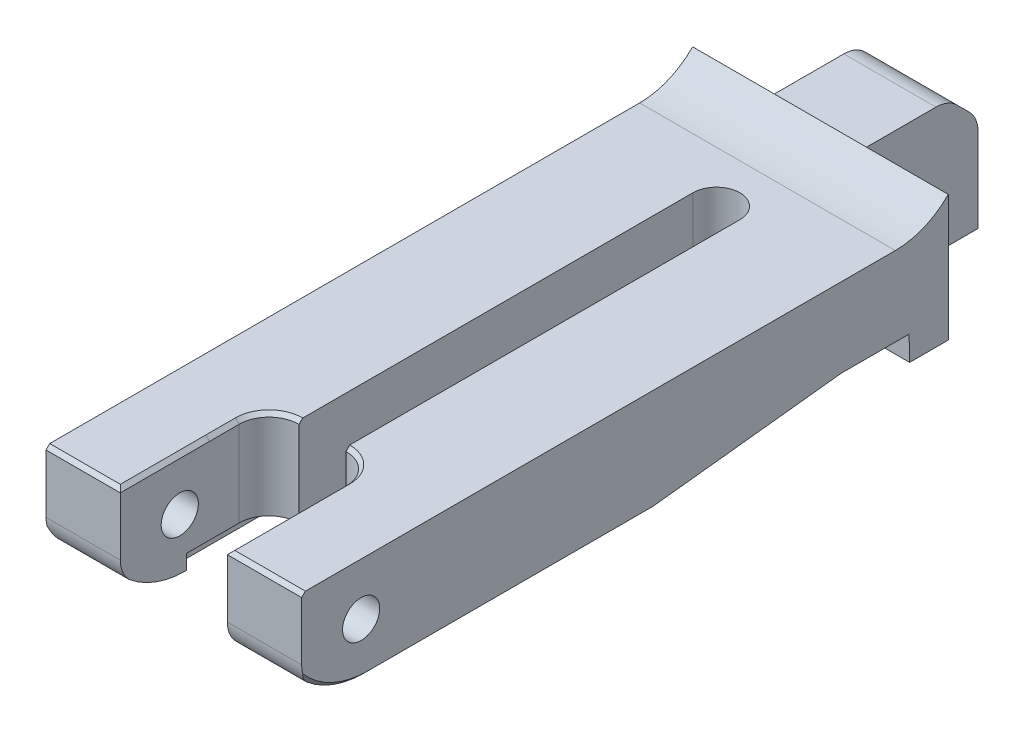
ISO-10303-21;
HEADER;
FILE_DESCRIPTION(('STEP AP214'),'2;1');
FILE_NAME('part.step','',(''),(''),'','','');
FILE_SCHEMA(('AUTOMOTIVE_DESIGN { 1 0 10303 214 1 1 1 1 }'));
ENDSEC;
DATA;
#1=APPLICATION_CONTEXT('core data for automotive mechanical design processes');
#2=APPLICATION_PROTOCOL_DEFINITION('international standard','automotive_design',2000,#1);
#3=PRODUCT_CONTEXT('',#1,'mechanical');
#4=PRODUCT('Part','Part','',(#3));
#5=PRODUCT_RELATED_PRODUCT_CATEGORY('part','',(#4));
#6=PRODUCT_DEFINITION_FORMATION('','',#4);
#7=PRODUCT_DEFINITION_CONTEXT('part definition',#1,'design');
#8=PRODUCT_DEFINITION('design','',#6,#7);
#9=PRODUCT_DEFINITION_SHAPE('','',#8);
#10=(LENGTH_UNIT() NAMED_UNIT(*) SI_UNIT(.MILLI.,.METRE.));
#11=(NAMED_UNIT(*) PLANE_ANGLE_UNIT() SI_UNIT($,.RADIAN.));
#12=(NAMED_UNIT(*) SI_UNIT($,.STERADIAN.) SOLID_ANGLE_UNIT());
#13=UNCERTAINTY_MEASURE_WITH_UNIT(LENGTH_MEASURE(1.E-05),#10,'distance_accuracy_value','');
#14=(GEOMETRIC_REPRESENTATION_CONTEXT(3) GLOBAL_UNCERTAINTY_ASSIGNED_CONTEXT((#13)) GLOBAL_UNIT_ASSIGNED_CONTEXT((#10,
#11,#12)) REPRESENTATION_CONTEXT('',''));
#15=CARTESIAN_POINT('',(0.,0.,0.));
#16=DIRECTION('',(0.,0.,1.));
#17=DIRECTION('',(1.,0.,0.));
#18=AXIS2_PLACEMENT_3D('',#15,#16,#17);
#19=CARTESIAN_POINT('',(-4.3,3.53755509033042,-12.1598306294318));
#20=DIRECTION('',(0.,-1.,0.));
#21=DIRECTION('',(0.,0.,-1.));
#22=AXIS2_PLACEMENT_3D('',#19,#20,#21);
#23=PLANE('',#22);
#24=CARTESIAN_POINT('',(0.,3.53755509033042,-11.5));
#25=DIRECTION('',(0.,-1.,0.));
#26=DIRECTION('',(0.,0.,-1.));
#27=AXIS2_PLACEMENT_3D('',#24,#25,#26);
#28=CIRCLE('',#27,2.);
#29=CARTESIAN_POINT('',(2.,3.53755509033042,-11.5));
#30=VERTEX_POINT('',#29);
#31=CARTESIAN_POINT('',(1.88802106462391,3.53755509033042,-12.1598306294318));
#32=VERTEX_POINT('',#31);
#33=EDGE_CURVE('E514',#30,#32,#28,.F.);
#34=ORIENTED_EDGE('',*,*,#33,.F.);
#35=DIRECTION('',(1.,0.,0.));
#36=VECTOR('',#35,1.);
#37=CARTESIAN_POINT('',(2.,3.53755509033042,-11.5));
#38=LINE('',#37,#36);
#39=CARTESIAN_POINT('',(1.575,3.53755509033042,-11.5));
#40=VERTEX_POINT('',#39);
#41=EDGE_CURVE('E987',#40,#30,#38,.T.);
#42=ORIENTED_EDGE('',*,*,#41,.F.);
#43=CARTESIAN_POINT('',(0.,3.53755509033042,-11.5));
#44=DIRECTION('',(0.,-1.,0.));
#45=DIRECTION('',(0.,0.,-1.));
#46=AXIS2_PLACEMENT_3D('',#43,#44,#45);
#47=CIRCLE('',#46,1.575);
#48=CARTESIAN_POINT('',(-1.575,3.53755509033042,-11.5));
#49=VERTEX_POINT('',#48);
#50=EDGE_CURVE('E507',#40,#49,#47,.F.);
#51=ORIENTED_EDGE('',*,*,#50,.T.);
#52=DIRECTION('',(1.,0.,0.));
#53=VECTOR('',#52,1.);
#54=CARTESIAN_POINT('',(-2.,3.53755509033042,-11.5));
#55=LINE('',#54,#53);
#56=CARTESIAN_POINT('',(-2.,3.53755509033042,-11.5));
#57=VERTEX_POINT('',#56);
#58=EDGE_CURVE('E451',#57,#49,#55,.T.);
#59=ORIENTED_EDGE('',*,*,#58,.F.);
#60=CARTESIAN_POINT('',(-1.88802106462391,3.53755509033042,-12.1598306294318));
#61=VERTEX_POINT('',#60);
#62=EDGE_CURVE('E500',#61,#57,#28,.F.);
#63=ORIENTED_EDGE('',*,*,#62,.F.);
#64=DIRECTION('',(1.,0.,0.));
#65=VECTOR('',#64,1.);
#66=CARTESIAN_POINT('',(-4.3,3.53755509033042,-12.1598306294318));
#67=LINE('',#66,#65);
#68=CARTESIAN_POINT('',(-4.24907325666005,3.53755509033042,-12.1598306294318));
#69=VERTEX_POINT('',#68);
#70=EDGE_CURVE('E619',#69,#61,#67,.T.);
#71=ORIENTED_EDGE('',*,*,#70,.F.);
#72=CARTESIAN_POINT('',(0.,3.53755509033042,-11.5));
#73=DIRECTION('',(0.,1.,0.));
#74=DIRECTION('',(0.,0.,-1.));
#75=AXIS2_PLACEMENT_3D('',#72,#73,#74);
#76=CIRCLE('',#75,4.3);
#77=CARTESIAN_POINT('',(4.24907325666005,3.53755509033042,-12.1598306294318));
#78=VERTEX_POINT('',#77);
#79=EDGE_CURVE('E545',#78,#69,#76,.T.);
#80=ORIENTED_EDGE('',*,*,#79,.F.);
#81=EDGE_CURVE('E618',#32,#78,#67,.T.);
#82=ORIENTED_EDGE('',*,*,#81,.F.);
#83=EDGE_LOOP('',(#34,#42,#51,#59,#63,#71,#80,#82));
#84=FACE_BOUND('',#83,.T.);
#85=ADVANCED_FACE('F34',(#84),#23,.T.);
#86=CARTESIAN_POINT('',(-4.3,0.998405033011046,16.));
#87=DIRECTION('',(0.,-1.,0.));
#88=DIRECTION('',(0.,0.,-1.));
#89=AXIS2_PLACEMENT_3D('',#86,#87,#88);
#90=PLANE('',#89);
#91=DIRECTION('',(1.,0.,0.));
#92=VECTOR('',#91,1.);
#93=CARTESIAN_POINT('',(-4.3,0.998405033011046,2.75441365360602));
#94=LINE('',#93,#92);
#95=CARTESIAN_POINT('',(-4.3,0.998405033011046,2.75441365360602));
#96=VERTEX_POINT('',#95);
#97=CARTESIAN_POINT('',(-1.575,0.998405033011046,2.75441365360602));
#98=VERTEX_POINT('',#97);
#99=EDGE_CURVE('E431',#96,#98,#94,.T.);
#100=ORIENTED_EDGE('',*,*,#99,.T.);
#101=DIRECTION('',(0.,0.,-1.));
#102=VECTOR('',#101,1.);
#103=CARTESIAN_POINT('',(-1.575,0.998405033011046,16.));
#104=LINE('',#103,#102);
#105=CARTESIAN_POINT('',(-1.575,0.998405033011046,15.));
#106=VERTEX_POINT('',#105);
#107=EDGE_CURVE('E416',#106,#98,#104,.T.);
#108=ORIENTED_EDGE('',*,*,#107,.F.);
#109=DIRECTION('',(1.,0.,0.));
#110=VECTOR('',#109,1.);
#111=CARTESIAN_POINT('',(0.,0.998405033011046,15.));
#112=LINE('',#111,#110);
#113=CARTESIAN_POINT('',(-1.59999999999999,0.998405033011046,15.));
#114=VERTEX_POINT('',#113);
#115=EDGE_CURVE('E458',#114,#106,#112,.T.);
#116=ORIENTED_EDGE('',*,*,#115,.F.);
#117=CARTESIAN_POINT('',(-1.6,0.998405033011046,17.));
#118=DIRECTION('',(0.,-1.,0.));
#119=DIRECTION('',(0.,0.,1.));
#120=AXIS2_PLACEMENT_3D('',#117,#118,#119);
#121=CIRCLE('',#120,2.);
#122=CARTESIAN_POINT('',(-3.6,0.998405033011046,17.));
#123=VERTEX_POINT('',#122);
#124=EDGE_CURVE('E427',#123,#114,#121,.T.);
#125=ORIENTED_EDGE('',*,*,#124,.F.);
#126=DIRECTION('',(0.,0.,1.));
#127=VECTOR('',#126,1.);
#128=CARTESIAN_POINT('',(-3.6,0.998405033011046,25.));
#129=LINE('',#128,#127);
#130=CARTESIAN_POINT('',(-3.6,0.998405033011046,20.5450324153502));
#131=VERTEX_POINT('',#130);
#132=EDGE_CURVE('E498',#123,#131,#129,.T.);
#133=ORIENTED_EDGE('',*,*,#132,.T.);
#134=DIRECTION('',(1.,0.,0.));
#135=VECTOR('',#134,1.);
#136=CARTESIAN_POINT('',(4.29086829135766,0.998405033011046,20.5450324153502));
#137=LINE('',#136,#135);
#138=CARTESIAN_POINT('',(-4.3,0.998405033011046,20.5450324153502));
#139=VERTEX_POINT('',#138);
#140=EDGE_CURVE('E472',#139,#131,#137,.T.);
#141=ORIENTED_EDGE('',*,*,#140,.F.);
#142=DIRECTION('',(0.,0.,-1.));
#143=VECTOR('',#142,1.);
#144=CARTESIAN_POINT('',(-4.3,0.998405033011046,16.));
#145=LINE('',#144,#143);
#146=EDGE_CURVE('E434',#139,#96,#145,.T.);
#147=ORIENTED_EDGE('',*,*,#146,.T.);
#148=EDGE_LOOP('',(#100,#108,#116,#125,#133,#141,#147));
#149=FACE_BOUND('',#148,.T.);
#150=ADVANCED_FACE('F432',(#149),#90,.T.);
#151=CARTESIAN_POINT('',(0.,8.49050107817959,15.));
#152=DIRECTION('',(0.,0.,-1.));
#153=DIRECTION('',(-1.,0.,0.));
#154=AXIS2_PLACEMENT_3D('',#151,#152,#153);
#155=PLANE('',#154);
#156=DIRECTION('',(0.,1.,0.));
#157=VECTOR('',#156,1.);
#158=CARTESIAN_POINT('',(-1.575,8.49050107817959,15.));
#159=LINE('',#158,#157);
#160=CARTESIAN_POINT('',(-1.575,6.75,15.));
#161=VERTEX_POINT('',#160);
#162=EDGE_CURVE('E423',#106,#161,#159,.T.);
#163=ORIENTED_EDGE('',*,*,#162,.T.);
#164=DIRECTION('',(-1.,0.,0.));
#165=VECTOR('',#164,1.);
#166=CARTESIAN_POINT('',(0.,6.75,15.));
#167=LINE('',#166,#165);
#168=CARTESIAN_POINT('',(-1.59999999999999,6.75,15.));
#169=VERTEX_POINT('',#168);
#170=EDGE_CURVE('E43',#161,#169,#167,.T.);
#171=ORIENTED_EDGE('',*,*,#170,.T.);
#172=DIRECTION('',(0.,-1.,0.));
#173=VECTOR('',#172,1.);
#174=CARTESIAN_POINT('',(-1.59999999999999,8.49050107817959,15.));
#175=LINE('',#174,#173);
#176=EDGE_CURVE('E469',#169,#114,#175,.T.);
#177=ORIENTED_EDGE('',*,*,#176,.T.);
#178=ORIENTED_EDGE('',*,*,#115,.T.);
#179=EDGE_LOOP('',(#163,#171,#177,#178));
#180=FACE_BOUND('',#179,.T.);
#181=ADVANCED_FACE('F956',(#180),#155,.F.);
#182=CARTESIAN_POINT('',(0.,0.,0.));
#183=DIRECTION('',(0.,-1.,0.));
#184=DIRECTION('',(0.,0.,-1.));
#185=AXIS2_PLACEMENT_3D('',#182,#183,#184);
#186=PLANE('',#185);
#187=DIRECTION('',(0.,0.,1.));
#188=VECTOR('',#187,1.);
#189=CARTESIAN_POINT('',(-4.3,0.,-15.9));
#190=LINE('',#189,#188);
#191=CARTESIAN_POINT('',(-4.3,0.,1.34025337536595));
#192=VERTEX_POINT('',#191);
#193=CARTESIAN_POINT('',(-4.3,0.,20.5450324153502));
#194=VERTEX_POINT('',#193);
#195=EDGE_CURVE('E608',#192,#194,#190,.T.);
#196=ORIENTED_EDGE('',*,*,#195,.T.);
#197=DIRECTION('',(-1.,0.,0.));
#198=VECTOR('',#197,1.);
#199=CARTESIAN_POINT('',(-8.6,0.,20.5450324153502));
#200=LINE('',#199,#198);
#201=CARTESIAN_POINT('',(-8.35,0.,20.5450324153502));
#202=VERTEX_POINT('',#201);
#203=EDGE_CURVE('E724',#194,#202,#200,.T.);
#204=ORIENTED_EDGE('',*,*,#203,.T.);
#205=DIRECTION('',(0.,0.,-1.));
#206=VECTOR('',#205,1.);
#207=CARTESIAN_POINT('',(-8.35,0.,1.34025337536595));
#208=LINE('',#207,#206);
#209=CARTESIAN_POINT('',(-8.35,0.,1.34025337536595));
#210=VERTEX_POINT('',#209);
#211=EDGE_CURVE('E1086',#202,#210,#208,.T.);
#212=ORIENTED_EDGE('',*,*,#211,.T.);
#213=DIRECTION('',(-1.,0.,0.));
#214=VECTOR('',#213,1.);
#215=CARTESIAN_POINT('',(10.,0.,1.34025337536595));
#216=LINE('',#215,#214);
#217=EDGE_CURVE('E570',#192,#210,#216,.T.);
#218=ORIENTED_EDGE('',*,*,#217,.F.);
#219=EDGE_LOOP('',(#196,#204,#212,#218));
#220=FACE_BOUND('',#219,.T.);
#221=ADVANCED_FACE('F857',(#220),#186,.T.);
#222=CARTESIAN_POINT('',(0.,0.,-11.5));
#223=DIRECTION('',(0.,1.,0.));
#224=DIRECTION('',(0.,0.,1.));
#225=AXIS2_PLACEMENT_3D('',#222,#223,#224);
#226=CYLINDRICAL_SURFACE('',#225,2.);
#227=CARTESIAN_POINT('',(0.,3.42521892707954,-11.5));
#228=DIRECTION('',(0.,-0.985815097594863,-0.167835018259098));
#229=DIRECTION('',(0.,0.167835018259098,-0.985815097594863));
#230=AXIS2_PLACEMENT_3D('',#227,#228,#229);
#231=ELLIPSE('',#230,2.02877801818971,2.);
#232=CARTESIAN_POINT('',(-2.,3.42521892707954,-11.5));
#233=VERTEX_POINT('',#232);
#234=EDGE_CURVE('E628',#61,#233,#231,.F.);
#235=ORIENTED_EDGE('',*,*,#234,.F.);
#236=ORIENTED_EDGE('',*,*,#62,.T.);
#237=DIRECTION('',(0.,1.,0.));
#238=VECTOR('',#237,1.);
#239=CARTESIAN_POINT('',(-2.,0.,-11.5));
#240=LINE('',#239,#238);
#241=EDGE_CURVE('E644',#233,#57,#240,.T.);
#242=ORIENTED_EDGE('',*,*,#241,.F.);
#243=EDGE_LOOP('',(#235,#236,#242));
#244=FACE_BOUND('',#243,.T.);
#245=ADVANCED_FACE('F823',(#244),#226,.F.);
#246=CARTESIAN_POINT('',(3.1,7.,-24.5));
#247=DIRECTION('',(-1.,0.,0.));
#248=DIRECTION('',(0.,0.,1.));
#249=AXIS2_PLACEMENT_3D('',#246,#247,#248);
#250=PLANE('',#249);
#251=CARTESIAN_POINT('',(3.1,3.50000000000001,-21.5));
#252=DIRECTION('',(-1.,0.,0.));
#253=DIRECTION('',(0.,0.,1.));
#254=AXIS2_PLACEMENT_3D('',#251,#252,#253);
#255=CIRCLE('',#254,1.2);
#256=CARTESIAN_POINT('',(3.1,3.50000000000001,-22.7));
#257=VERTEX_POINT('',#256);
#258=EDGE_CURVE('E629',#257,#257,#255,.T.);
#259=ORIENTED_EDGE('',*,*,#258,.T.);
#260=EDGE_LOOP('',(#259));
#261=FACE_BOUND('',#260,.T.);
#262=DIRECTION('',(0.,-1.,0.));
#263=VECTOR('',#262,1.);
#264=CARTESIAN_POINT('',(3.1,0.,-26.));
#265=LINE('',#264,#263);
#266=CARTESIAN_POINT('',(3.1,5.66207395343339,-26.));
#267=VERTEX_POINT('',#266);
#268=CARTESIAN_POINT('',(3.1,0.,-26.));
#269=VERTEX_POINT('',#268);
#270=EDGE_CURVE('E529',#267,#269,#265,.T.);
#271=ORIENTED_EDGE('',*,*,#270,.F.);
#272=CARTESIAN_POINT('',(3.1,5.66207395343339,-24.));
#273=DIRECTION('',(-1.,0.,0.));
#274=DIRECTION('',(0.,0.,1.));
#275=AXIS2_PLACEMENT_3D('',#272,#273,#274);
#276=CIRCLE('',#275,2.);
#277=CARTESIAN_POINT('',(3.1,7.07628751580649,-25.4142135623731));
#278=VERTEX_POINT('',#277);
#279=EDGE_CURVE('E1167',#267,#278,#276,.F.);
#280=ORIENTED_EDGE('',*,*,#279,.T.);
#281=DIRECTION('',(0.,0.707106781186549,0.707106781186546));
#282=VECTOR('',#281,1.);
#283=CARTESIAN_POINT('',(3.1,8.49050107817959,-24.));
#284=LINE('',#283,#282);
#285=CARTESIAN_POINT('',(3.1,7.90471464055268,-24.5857864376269));
#286=VERTEX_POINT('',#285);
#287=EDGE_CURVE('E1159',#278,#286,#284,.T.);
#288=ORIENTED_EDGE('',*,*,#287,.T.);
#289=CARTESIAN_POINT('',(3.1,6.49050107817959,-23.1715728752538));
#290=DIRECTION('',(-1.,0.,0.));
#291=DIRECTION('',(0.,0.,1.));
#292=AXIS2_PLACEMENT_3D('',#289,#290,#291);
#293=CIRCLE('',#292,2.);
#294=CARTESIAN_POINT('',(3.1,8.49050107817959,-23.1715728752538));
#295=VERTEX_POINT('',#294);
#296=EDGE_CURVE('E1165',#286,#295,#293,.F.);
#297=ORIENTED_EDGE('',*,*,#296,.T.);
#298=DIRECTION('',(0.,0.,1.));
#299=VECTOR('',#298,1.);
#300=CARTESIAN_POINT('',(3.1,8.49050107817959,0.));
#301=LINE('',#300,#299);
#302=CARTESIAN_POINT('',(3.1,8.49050107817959,-18.5));
#303=VERTEX_POINT('',#302);
#304=EDGE_CURVE('E531',#295,#303,#301,.T.);
#305=ORIENTED_EDGE('',*,*,#304,.T.);
#306=DIRECTION('',(0.,-1.,0.));
#307=VECTOR('',#306,1.);
#308=CARTESIAN_POINT('',(3.1,7.,-18.5));
#309=LINE('',#308,#307);
#310=CARTESIAN_POINT('',(3.1,0.,-18.5));
#311=VERTEX_POINT('',#310);
#312=EDGE_CURVE('E681',#303,#311,#309,.T.);
#313=ORIENTED_EDGE('',*,*,#312,.T.);
#314=DIRECTION('',(0.,0.,-1.));
#315=VECTOR('',#314,1.);
#316=CARTESIAN_POINT('',(3.1,0.,-24.5));
#317=LINE('',#316,#315);
#318=EDGE_CURVE('E660',#311,#269,#317,.T.);
#319=ORIENTED_EDGE('',*,*,#318,.T.);
#320=EDGE_LOOP('',(#271,#280,#288,#297,#305,#313,#319));
#321=FACE_BOUND('',#320,.T.);
#322=ADVANCED_FACE('F819',(#261,#321),#250,.F.);
#323=CARTESIAN_POINT('',(-3.1,7.,-18.5));
#324=DIRECTION('',(1.,0.,0.));
#325=DIRECTION('',(0.,0.,-1.));
#326=AXIS2_PLACEMENT_3D('',#323,#324,#325);
#327=PLANE('',#326);
#328=CARTESIAN_POINT('',(-3.1,3.50000000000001,-21.5));
#329=DIRECTION('',(1.,0.,0.));
#330=DIRECTION('',(0.,0.,-1.));
#331=AXIS2_PLACEMENT_3D('',#328,#329,#330);
#332=CIRCLE('',#331,1.2);
#333=CARTESIAN_POINT('',(-3.1,3.50000000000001,-22.7));
#334=VERTEX_POINT('',#333);
#335=EDGE_CURVE('E633',#334,#334,#332,.T.);
#336=ORIENTED_EDGE('',*,*,#335,.T.);
#337=EDGE_LOOP('',(#336));
#338=FACE_BOUND('',#337,.T.);
#339=DIRECTION('',(0.,-0.707106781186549,-0.707106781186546));
#340=VECTOR('',#339,1.);
#341=CARTESIAN_POINT('',(-3.1,8.49050107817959,-24.));
#342=LINE('',#341,#340);
#343=CARTESIAN_POINT('',(-3.1,7.90471464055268,-24.5857864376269));
#344=VERTEX_POINT('',#343);
#345=CARTESIAN_POINT('',(-3.1,7.07628751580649,-25.4142135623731));
#346=VERTEX_POINT('',#345);
#347=EDGE_CURVE('E1155',#344,#346,#342,.T.);
#348=ORIENTED_EDGE('',*,*,#347,.T.);
#349=CARTESIAN_POINT('',(-3.1,5.66207395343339,-24.));
#350=DIRECTION('',(1.,0.,0.));
#351=DIRECTION('',(0.,0.,-1.));
#352=AXIS2_PLACEMENT_3D('',#349,#350,#351);
#353=CIRCLE('',#352,2.);
#354=CARTESIAN_POINT('',(-3.1,5.66207395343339,-26.));
#355=VERTEX_POINT('',#354);
#356=EDGE_CURVE('E1175',#346,#355,#353,.F.);
#357=ORIENTED_EDGE('',*,*,#356,.T.);
#358=DIRECTION('',(0.,1.,0.));
#359=VECTOR('',#358,1.);
#360=CARTESIAN_POINT('',(-3.1,0.,-26.));
#361=LINE('',#360,#359);
#362=CARTESIAN_POINT('',(-3.1,0.,-26.));
#363=VERTEX_POINT('',#362);
#364=EDGE_CURVE('E535',#363,#355,#361,.T.);
#365=ORIENTED_EDGE('',*,*,#364,.F.);
#366=DIRECTION('',(0.,0.,1.));
#367=VECTOR('',#366,1.);
#368=CARTESIAN_POINT('',(-3.1,0.,-18.5));
#369=LINE('',#368,#367);
#370=CARTESIAN_POINT('',(-3.1,0.,-18.5));
#371=VERTEX_POINT('',#370);
#372=EDGE_CURVE('E663',#363,#371,#369,.T.);
#373=ORIENTED_EDGE('',*,*,#372,.T.);
#374=DIRECTION('',(0.,-1.,0.));
#375=VECTOR('',#374,1.);
#376=CARTESIAN_POINT('',(-3.1,7.,-18.5));
#377=LINE('',#376,#375);
#378=CARTESIAN_POINT('',(-3.1,8.49050107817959,-18.5));
#379=VERTEX_POINT('',#378);
#380=EDGE_CURVE('E678',#379,#371,#377,.T.);
#381=ORIENTED_EDGE('',*,*,#380,.F.);
#382=DIRECTION('',(0.,0.,-1.));
#383=VECTOR('',#382,1.);
#384=CARTESIAN_POINT('',(-3.1,8.49050107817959,0.));
#385=LINE('',#384,#383);
#386=CARTESIAN_POINT('',(-3.1,8.49050107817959,-23.1715728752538));
#387=VERTEX_POINT('',#386);
#388=EDGE_CURVE('E525',#379,#387,#385,.T.);
#389=ORIENTED_EDGE('',*,*,#388,.T.);
#390=CARTESIAN_POINT('',(-3.1,6.49050107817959,-23.1715728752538));
#391=DIRECTION('',(1.,0.,0.));
#392=DIRECTION('',(0.,0.,-1.));
#393=AXIS2_PLACEMENT_3D('',#390,#391,#392);
#394=CIRCLE('',#393,2.);
#395=EDGE_CURVE('E1173',#387,#344,#394,.F.);
#396=ORIENTED_EDGE('',*,*,#395,.T.);
#397=EDGE_LOOP('',(#348,#357,#365,#373,#381,#389,#396));
#398=FACE_BOUND('',#397,.T.);
#399=ADVANCED_FACE('F822',(#338,#398),#327,.F.);
#400=CARTESIAN_POINT('',(0.,7.,0.));
#401=DIRECTION('',(0.,-1.,0.));
#402=DIRECTION('',(0.,0.,-1.));
#403=AXIS2_PLACEMENT_3D('',#400,#401,#402);
#404=PLANE('',#403);
#405=DIRECTION('',(0.,0.,-1.));
#406=VECTOR('',#405,1.);
#407=CARTESIAN_POINT('',(1.575,7.,10.));
#408=LINE('',#407,#406);
#409=CARTESIAN_POINT('',(1.575,7.,14.75));
#410=VERTEX_POINT('',#409);
#411=CARTESIAN_POINT('',(1.575,7.,-11.5));
#412=VERTEX_POINT('',#411);
#413=EDGE_CURVE('E501',#410,#412,#408,.T.);
#414=ORIENTED_EDGE('',*,*,#413,.F.);
#415=DIRECTION('',(1.,0.,0.));
#416=VECTOR('',#415,1.);
#417=CARTESIAN_POINT('',(0.,7.,14.75));
#418=LINE('',#417,#416);
#419=CARTESIAN_POINT('',(1.59999999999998,7.,14.75));
#420=VERTEX_POINT('',#419);
#421=EDGE_CURVE('E1020',#410,#420,#418,.T.);
#422=ORIENTED_EDGE('',*,*,#421,.T.);
#423=CARTESIAN_POINT('',(1.6,7.,17.));
#424=DIRECTION('',(0.,-1.,0.));
#425=DIRECTION('',(0.,0.,-1.));
#426=AXIS2_PLACEMENT_3D('',#423,#424,#425);
#427=CIRCLE('',#426,2.24999999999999);
#428=CARTESIAN_POINT('',(3.84999999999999,7.,17.));
#429=VERTEX_POINT('',#428);
#430=EDGE_CURVE('E1055',#420,#429,#427,.T.);
#431=ORIENTED_EDGE('',*,*,#430,.T.);
#432=DIRECTION('',(0.,0.,1.));
#433=VECTOR('',#432,1.);
#434=CARTESIAN_POINT('',(3.84999999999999,7.,0.));
#435=LINE('',#434,#433);
#436=CARTESIAN_POINT('',(3.85,7.,19.));
#437=VERTEX_POINT('',#436);
#438=EDGE_CURVE('E1061',#429,#437,#435,.T.);
#439=ORIENTED_EDGE('',*,*,#438,.T.);
#440=DIRECTION('',(0.,0.,1.));
#441=VECTOR('',#440,1.);
#442=CARTESIAN_POINT('',(3.85,7.,0.));
#443=LINE('',#442,#441);
#444=CARTESIAN_POINT('',(3.85,7.,24.75));
#445=VERTEX_POINT('',#444);
#446=EDGE_CURVE('E1215',#437,#445,#443,.T.);
#447=ORIENTED_EDGE('',*,*,#446,.T.);
#448=DIRECTION('',(1.,0.,0.));
#449=VECTOR('',#448,1.);
#450=CARTESIAN_POINT('',(0.,7.,24.75));
#451=LINE('',#450,#449);
#452=CARTESIAN_POINT('',(8.6,7.,24.75));
#453=VERTEX_POINT('',#452);
#454=EDGE_CURVE('E1265',#445,#453,#451,.T.);
#455=ORIENTED_EDGE('',*,*,#454,.T.);
#456=DIRECTION('',(0.,0.,-1.));
#457=VECTOR('',#456,1.);
#458=CARTESIAN_POINT('',(8.6,7.,25.));
#459=LINE('',#458,#457);
#460=CARTESIAN_POINT('',(8.6,7.,-14.9386214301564));
#461=VERTEX_POINT('',#460);
#462=EDGE_CURVE('E650',#453,#461,#459,.T.);
#463=ORIENTED_EDGE('',*,*,#462,.T.);
#464=DIRECTION('',(-1.,0.,0.));
#465=VECTOR('',#464,1.);
#466=CARTESIAN_POINT('',(0.,7.,-14.9386214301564));
#467=LINE('',#466,#465);
#468=CARTESIAN_POINT('',(-8.6,7.,-14.9386214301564));
#469=VERTEX_POINT('',#468);
#470=EDGE_CURVE('E1153',#461,#469,#467,.T.);
#471=ORIENTED_EDGE('',*,*,#470,.T.);
#472=DIRECTION('',(0.,0.,1.));
#473=VECTOR('',#472,1.);
#474=CARTESIAN_POINT('',(-8.6,7.,25.));
#475=LINE('',#474,#473);
#476=CARTESIAN_POINT('',(-8.6,7.,24.75));
#477=VERTEX_POINT('',#476);
#478=EDGE_CURVE('E653',#469,#477,#475,.T.);
#479=ORIENTED_EDGE('',*,*,#478,.T.);
#480=DIRECTION('',(1.,0.,0.));
#481=VECTOR('',#480,1.);
#482=CARTESIAN_POINT('',(0.,7.,24.75));
#483=LINE('',#482,#481);
#484=CARTESIAN_POINT('',(-3.85,7.,24.75));
#485=VERTEX_POINT('',#484);
#486=EDGE_CURVE('E1209',#477,#485,#483,.T.);
#487=ORIENTED_EDGE('',*,*,#486,.T.);
#488=DIRECTION('',(0.,0.,-1.));
#489=VECTOR('',#488,1.);
#490=CARTESIAN_POINT('',(-3.85,7.,0.));
#491=LINE('',#490,#489);
#492=CARTESIAN_POINT('',(-3.85,7.,19.));
#493=VERTEX_POINT('',#492);
#494=EDGE_CURVE('E1212',#485,#493,#491,.T.);
#495=ORIENTED_EDGE('',*,*,#494,.T.);
#496=DIRECTION('',(0.,0.,-1.));
#497=VECTOR('',#496,1.);
#498=CARTESIAN_POINT('',(-3.85,7.,0.));
#499=LINE('',#498,#497);
#500=CARTESIAN_POINT('',(-3.85,7.,17.));
#501=VERTEX_POINT('',#500);
#502=EDGE_CURVE('E1053',#493,#501,#499,.T.);
#503=ORIENTED_EDGE('',*,*,#502,.T.);
#504=CARTESIAN_POINT('',(-1.6,7.,17.));
#505=DIRECTION('',(0.,-1.,0.));
#506=DIRECTION('',(0.,0.,-1.));
#507=AXIS2_PLACEMENT_3D('',#504,#505,#506);
#508=CIRCLE('',#507,2.25);
#509=CARTESIAN_POINT('',(-1.59999999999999,7.,14.75));
#510=VERTEX_POINT('',#509);
#511=EDGE_CURVE('E1047',#501,#510,#508,.T.);
#512=ORIENTED_EDGE('',*,*,#511,.T.);
#513=DIRECTION('',(1.,0.,0.));
#514=VECTOR('',#513,1.);
#515=CARTESIAN_POINT('',(0.,7.,14.75));
#516=LINE('',#515,#514);
#517=CARTESIAN_POINT('',(-1.575,7.,14.75));
#518=VERTEX_POINT('',#517);
#519=EDGE_CURVE('E1051',#510,#518,#516,.T.);
#520=ORIENTED_EDGE('',*,*,#519,.T.);
#521=DIRECTION('',(0.,0.,1.));
#522=VECTOR('',#521,1.);
#523=CARTESIAN_POINT('',(-1.575,7.,-11.5));
#524=LINE('',#523,#522);
#525=CARTESIAN_POINT('',(-1.575,7.,-11.5));
#526=VERTEX_POINT('',#525);
#527=EDGE_CURVE('E505',#526,#518,#524,.T.);
#528=ORIENTED_EDGE('',*,*,#527,.F.);
#529=CARTESIAN_POINT('',(0.,7.,-11.5));
#530=DIRECTION('',(0.,1.,0.));
#531=DIRECTION('',(0.,0.,1.));
#532=AXIS2_PLACEMENT_3D('',#529,#530,#531);
#533=CIRCLE('',#532,1.575);
#534=EDGE_CURVE('E504',#412,#526,#533,.T.);
#535=ORIENTED_EDGE('',*,*,#534,.F.);
#536=EDGE_LOOP('',(#414,#422,#431,#439,#447,#455,#463,#471,#479,#487,#495,#503,#512,#520,#528,#535));
#537=FACE_BOUND('',#536,.T.);
#538=ADVANCED_FACE('F827',(#537),#404,.F.);
#539=CARTESIAN_POINT('',(-4.3,0.,0.));
#540=DIRECTION('',(-1.,0.,0.));
#541=DIRECTION('',(0.,0.,1.));
#542=AXIS2_PLACEMENT_3D('',#539,#540,#541);
#543=PLANE('',#542);
#544=DIRECTION('',(0.,0.167835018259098,-0.985815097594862));
#545=VECTOR('',#544,1.);
#546=CARTESIAN_POINT('',(-4.3,0.998405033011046,2.75441365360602));
#547=LINE('',#546,#545);
#548=CARTESIAN_POINT('',(-4.3,3.42521892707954,-11.5));
#549=VERTEX_POINT('',#548);
#550=EDGE_CURVE('E611',#96,#549,#547,.T.);
#551=ORIENTED_EDGE('',*,*,#550,.F.);
#552=ORIENTED_EDGE('',*,*,#146,.F.);
#553=DIRECTION('',(0.,-1.,0.));
#554=VECTOR('',#553,1.);
#555=CARTESIAN_POINT('',(-4.3,15.6550214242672,20.5450324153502));
#556=LINE('',#555,#554);
#557=EDGE_CURVE('E481',#139,#194,#556,.T.);
#558=ORIENTED_EDGE('',*,*,#557,.T.);
#559=ORIENTED_EDGE('',*,*,#195,.F.);
#560=DIRECTION('',(0.,-0.111459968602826,0.99376892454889));
#561=VECTOR('',#560,1.);
#562=CARTESIAN_POINT('',(-4.3,0.148453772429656,0.0166504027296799));
#563=LINE('',#562,#561);
#564=CARTESIAN_POINT('',(-4.3,1.42,-11.3203627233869));
#565=VERTEX_POINT('',#564);
#566=EDGE_CURVE('E582',#565,#192,#563,.T.);
#567=ORIENTED_EDGE('',*,*,#566,.F.);
#568=DIRECTION('',(0.,0.,1.));
#569=VECTOR('',#568,1.);
#570=CARTESIAN_POINT('',(-4.3,1.42,0.));
#571=LINE('',#570,#569);
#572=CARTESIAN_POINT('',(-4.3,1.42,-11.5));
#573=VERTEX_POINT('',#572);
#574=EDGE_CURVE('E584',#573,#565,#571,.T.);
#575=ORIENTED_EDGE('',*,*,#574,.F.);
#576=DIRECTION('',(0.,1.,0.));
#577=VECTOR('',#576,1.);
#578=CARTESIAN_POINT('',(-4.3,-8.24022774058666,-11.5));
#579=LINE('',#578,#577);
#580=EDGE_CURVE('E547',#573,#549,#579,.T.);
#581=ORIENTED_EDGE('',*,*,#580,.T.);
#582=EDGE_LOOP('',(#551,#552,#558,#559,#567,#575,#581));
#583=FACE_BOUND('',#582,.T.);
#584=ADVANCED_FACE('F860',(#583),#543,.F.);
#585=CARTESIAN_POINT('',(4.3,0.,0.));
#586=DIRECTION('',(-1.,0.,0.));
#587=DIRECTION('',(0.,0.,1.));
#588=AXIS2_PLACEMENT_3D('',#585,#586,#587);
#589=PLANE('',#588);
#590=DIRECTION('',(0.,1.,0.));
#591=VECTOR('',#590,1.);
#592=CARTESIAN_POINT('',(4.3,-8.24022774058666,-11.5));
#593=LINE('',#592,#591);
#594=CARTESIAN_POINT('',(4.3,1.42,-11.5));
#595=VERTEX_POINT('',#594);
#596=CARTESIAN_POINT('',(4.3,3.42521892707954,-11.5));
#597=VERTEX_POINT('',#596);
#598=EDGE_CURVE('E548',#595,#597,#593,.T.);
#599=ORIENTED_EDGE('',*,*,#598,.F.);
#600=DIRECTION('',(0.,0.,1.));
#601=VECTOR('',#600,1.);
#602=CARTESIAN_POINT('',(4.3,1.42,0.));
#603=LINE('',#602,#601);
#604=CARTESIAN_POINT('',(4.3,1.42,-11.3203627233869));
#605=VERTEX_POINT('',#604);
#606=EDGE_CURVE('E694',#595,#605,#603,.T.);
#607=ORIENTED_EDGE('',*,*,#606,.T.);
#608=DIRECTION('',(0.,-0.111459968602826,0.99376892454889));
#609=VECTOR('',#608,1.);
#610=CARTESIAN_POINT('',(4.3,0.148453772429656,0.0166504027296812));
#611=LINE('',#610,#609);
#612=CARTESIAN_POINT('',(4.3,0.,1.34025337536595));
#613=VERTEX_POINT('',#612);
#614=EDGE_CURVE('E687',#605,#613,#611,.T.);
#615=ORIENTED_EDGE('',*,*,#614,.T.);
#616=DIRECTION('',(0.,0.,1.));
#617=VECTOR('',#616,1.);
#618=CARTESIAN_POINT('',(4.3,0.,-15.9));
#619=LINE('',#618,#617);
#620=CARTESIAN_POINT('',(4.3,0.,16.));
#621=VERTEX_POINT('',#620);
#622=EDGE_CURVE('E594',#613,#621,#619,.T.);
#623=ORIENTED_EDGE('',*,*,#622,.T.);
#624=DIRECTION('',(0.,1.,0.));
#625=VECTOR('',#624,1.);
#626=CARTESIAN_POINT('',(4.3,0.,16.));
#627=LINE('',#626,#625);
#628=CARTESIAN_POINT('',(4.3,0.998405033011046,16.));
#629=VERTEX_POINT('',#628);
#630=EDGE_CURVE('E597',#621,#629,#627,.T.);
#631=ORIENTED_EDGE('',*,*,#630,.T.);
#632=DIRECTION('',(0.,0.,-1.));
#633=VECTOR('',#632,1.);
#634=CARTESIAN_POINT('',(4.3,0.998405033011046,16.));
#635=LINE('',#634,#633);
#636=CARTESIAN_POINT('',(4.3,0.998405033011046,2.75441365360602));
#637=VERTEX_POINT('',#636);
#638=EDGE_CURVE('E600',#629,#637,#635,.T.);
#639=ORIENTED_EDGE('',*,*,#638,.T.);
#640=DIRECTION('',(0.,0.167835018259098,-0.985815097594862));
#641=VECTOR('',#640,1.);
#642=CARTESIAN_POINT('',(4.3,0.998405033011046,2.75441365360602));
#643=LINE('',#642,#641);
#644=EDGE_CURVE('E603',#637,#597,#643,.T.);
#645=ORIENTED_EDGE('',*,*,#644,.T.);
#646=EDGE_LOOP('',(#599,#607,#615,#623,#631,#639,#645));
#647=FACE_BOUND('',#646,.T.);
#648=ADVANCED_FACE('F885',(#647),#589,.T.);
#649=CARTESIAN_POINT('',(-4.3,0.998405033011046,2.75441365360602));
#650=DIRECTION('',(0.,-0.985815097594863,-0.167835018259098));
#651=DIRECTION('',(0.,0.167835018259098,-0.985815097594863));
#652=AXIS2_PLACEMENT_3D('',#649,#650,#651);
#653=PLANE('',#652);
#654=ORIENTED_EDGE('',*,*,#550,.T.);
#655=CARTESIAN_POINT('',(0.,3.42521892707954,-11.5));
#656=DIRECTION('',(0.,-0.985815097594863,-0.167835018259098));
#657=DIRECTION('',(0.,0.167835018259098,-0.985815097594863));
#658=AXIS2_PLACEMENT_3D('',#655,#656,#657);
#659=ELLIPSE('',#658,4.36187273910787,4.3);
#660=EDGE_CURVE('E563',#549,#69,#659,.T.);
#661=ORIENTED_EDGE('',*,*,#660,.T.);
#662=ORIENTED_EDGE('',*,*,#70,.T.);
#663=ORIENTED_EDGE('',*,*,#234,.T.);
#664=DIRECTION('',(1.,0.,0.));
#665=VECTOR('',#664,1.);
#666=CARTESIAN_POINT('',(-1.99999999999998,3.42521892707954,-11.5));
#667=LINE('',#666,#665);
#668=CARTESIAN_POINT('',(-1.575,3.42521892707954,-11.5));
#669=VERTEX_POINT('',#668);
#670=EDGE_CURVE('E444',#233,#669,#667,.T.);
#671=ORIENTED_EDGE('',*,*,#670,.T.);
#672=DIRECTION('',(0.,-0.167835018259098,0.985815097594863));
#673=VECTOR('',#672,1.);
#674=CARTESIAN_POINT('',(-1.575,0.627989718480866,4.93012771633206));
#675=LINE('',#674,#673);
#676=EDGE_CURVE('E421',#669,#98,#675,.T.);
#677=ORIENTED_EDGE('',*,*,#676,.T.);
#678=ORIENTED_EDGE('',*,*,#99,.F.);
#679=EDGE_LOOP('',(#654,#661,#662,#663,#671,#677,#678));
#680=FACE_BOUND('',#679,.T.);
#681=ADVANCED_FACE('F442',(#680),#653,.T.);
#682=ORIENTED_EDGE('',*,*,#81,.T.);
#683=CARTESIAN_POINT('',(0.,3.42521892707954,-11.5));
#684=DIRECTION('',(0.,-0.985815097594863,-0.167835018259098));
#685=DIRECTION('',(0.,0.167835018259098,-0.985815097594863));
#686=AXIS2_PLACEMENT_3D('',#683,#684,#685);
#687=ELLIPSE('',#686,4.36187273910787,4.3);
#688=EDGE_CURVE('E551',#78,#597,#687,.T.);
#689=ORIENTED_EDGE('',*,*,#688,.T.);
#690=ORIENTED_EDGE('',*,*,#644,.F.);
#691=CARTESIAN_POINT('',(1.575,0.998405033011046,2.75441365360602));
#692=VERTEX_POINT('',#691);
#693=EDGE_CURVE('E439',#692,#637,#94,.T.);
#694=ORIENTED_EDGE('',*,*,#693,.F.);
#695=DIRECTION('',(0.,0.167835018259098,-0.985815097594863));
#696=VECTOR('',#695,1.);
#697=CARTESIAN_POINT('',(1.575,2.98644367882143,-8.92275915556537));
#698=LINE('',#697,#696);
#699=CARTESIAN_POINT('',(1.575,3.42521892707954,-11.5));
#700=VERTEX_POINT('',#699);
#701=EDGE_CURVE('E982',#692,#700,#698,.T.);
#702=ORIENTED_EDGE('',*,*,#701,.T.);
#703=DIRECTION('',(1.,0.,0.));
#704=VECTOR('',#703,1.);
#705=CARTESIAN_POINT('',(2.,3.42521892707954,-11.5));
#706=LINE('',#705,#704);
#707=CARTESIAN_POINT('',(2.,3.42521892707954,-11.5));
#708=VERTEX_POINT('',#707);
#709=EDGE_CURVE('E976',#700,#708,#706,.T.);
#710=ORIENTED_EDGE('',*,*,#709,.T.);
#711=EDGE_CURVE('E625',#708,#32,#231,.F.);
#712=ORIENTED_EDGE('',*,*,#711,.T.);
#713=EDGE_LOOP('',(#682,#689,#690,#694,#702,#710,#712));
#714=FACE_BOUND('',#713,.T.);
#715=ADVANCED_FACE('F811',(#714),#653,.T.);
#716=CARTESIAN_POINT('',(8.6,7.,25.));
#717=DIRECTION('',(-1.,0.,0.));
#718=DIRECTION('',(0.,0.,1.));
#719=AXIS2_PLACEMENT_3D('',#716,#717,#718);
#720=PLANE('',#719);
#721=CARTESIAN_POINT('',(8.6,3.5,21.));
#722=DIRECTION('',(1.,0.,0.));
#723=DIRECTION('',(0.,0.,-1.));
#724=AXIS2_PLACEMENT_3D('',#721,#722,#723);
#725=CIRCLE('',#724,1.25);
#726=CARTESIAN_POINT('',(8.6,3.5,19.75));
#727=VERTEX_POINT('',#726);
#728=EDGE_CURVE('E632',#727,#727,#725,.T.);
#729=ORIENTED_EDGE('',*,*,#728,.F.);
#730=EDGE_LOOP('',(#729));
#731=FACE_BOUND('',#730,.T.);
#732=DIRECTION('',(0.,0.,-1.));
#733=VECTOR('',#732,1.);
#734=CARTESIAN_POINT('',(8.6,1.67,-15.8703627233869));
#735=LINE('',#734,#733);
#736=CARTESIAN_POINT('',(8.6,1.67,-11.3063866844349));
#737=VERTEX_POINT('',#736);
#738=CARTESIAN_POINT('',(8.6,1.67,-15.8651448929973));
#739=VERTEX_POINT('',#738);
#740=EDGE_CURVE('E1100',#737,#739,#735,.T.);
#741=ORIENTED_EDGE('',*,*,#740,.T.);
#742=DIRECTION('',(0.,0.99978226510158,0.0208667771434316));
#743=VECTOR('',#742,1.);
#744=CARTESIAN_POINT('',(8.6,7.85021740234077,-15.7361555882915));
#745=LINE('',#744,#743);
#746=CARTESIAN_POINT('',(8.6,0.,-15.9));
#747=VERTEX_POINT('',#746);
#748=EDGE_CURVE('E592',#747,#739,#745,.T.);
#749=ORIENTED_EDGE('',*,*,#748,.F.);
#750=DIRECTION('',(0.,0.,-1.));
#751=VECTOR('',#750,1.);
#752=CARTESIAN_POINT('',(8.6,0.,25.));
#753=LINE('',#752,#751);
#754=CARTESIAN_POINT('',(8.6,0.,-18.5));
#755=VERTEX_POINT('',#754);
#756=EDGE_CURVE('E647',#747,#755,#753,.T.);
#757=ORIENTED_EDGE('',*,*,#756,.T.);
#758=DIRECTION('',(0.,-1.,0.));
#759=VECTOR('',#758,1.);
#760=CARTESIAN_POINT('',(8.6,7.,-18.5));
#761=LINE('',#760,#759);
#762=CARTESIAN_POINT('',(8.6,8.49050107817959,-18.5));
#763=VERTEX_POINT('',#762);
#764=EDGE_CURVE('E684',#763,#755,#761,.T.);
#765=ORIENTED_EDGE('',*,*,#764,.F.);
#766=CARTESIAN_POINT('',(8.6,12.,-14.9386214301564));
#767=DIRECTION('',(-1.,0.,0.));
#768=DIRECTION('',(0.,0.,1.));
#769=AXIS2_PLACEMENT_3D('',#766,#767,#768);
#770=CIRCLE('',#769,5.00000000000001);
#771=EDGE_CURVE('E513',#763,#461,#770,.T.);
#772=ORIENTED_EDGE('',*,*,#771,.T.);
#773=ORIENTED_EDGE('',*,*,#462,.F.);
#774=DIRECTION('',(0.,0.707106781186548,-0.707106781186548));
#775=VECTOR('',#774,1.);
#776=CARTESIAN_POINT('',(8.6,7.,24.75));
#777=LINE('',#776,#775);
#778=CARTESIAN_POINT('',(8.6,6.75000000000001,25.));
#779=VERTEX_POINT('',#778);
#780=EDGE_CURVE('E1094',#453,#779,#777,.F.);
#781=ORIENTED_EDGE('',*,*,#780,.T.);
#782=DIRECTION('',(0.,-1.,0.));
#783=VECTOR('',#782,1.);
#784=CARTESIAN_POINT('',(8.6,7.,25.));
#785=LINE('',#784,#783);
#786=CARTESIAN_POINT('',(8.6,2.8284271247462,25.));
#787=VERTEX_POINT('',#786);
#788=EDGE_CURVE('E656',#779,#787,#785,.T.);
#789=ORIENTED_EDGE('',*,*,#788,.T.);
#790=CARTESIAN_POINT('',(8.6,2.8284271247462,23.));
#791=DIRECTION('',(-1.,0.,0.));
#792=DIRECTION('',(0.,0.,1.));
#793=AXIS2_PLACEMENT_3D('',#790,#791,#792);
#794=CIRCLE('',#793,2.);
#795=CARTESIAN_POINT('',(8.6,2.26893152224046,24.9201470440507));
#796=VERTEX_POINT('',#795);
#797=EDGE_CURVE('E705',#787,#796,#794,.F.);
#798=ORIENTED_EDGE('',*,*,#797,.T.);
#799=CARTESIAN_POINT('',(8.6,6.,20.5450324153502));
#800=DIRECTION('',(-1.,0.,0.));
#801=DIRECTION('',(0.,0.,1.));
#802=AXIS2_PLACEMENT_3D('',#799,#800,#801);
#803=CIRCLE('',#802,5.75);
#804=CARTESIAN_POINT('',(8.6,0.25,20.5450324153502));
#805=VERTEX_POINT('',#804);
#806=EDGE_CURVE('E1102',#796,#805,#803,.F.);
#807=ORIENTED_EDGE('',*,*,#806,.T.);
#808=DIRECTION('',(0.,0.,-1.));
#809=VECTOR('',#808,1.);
#810=CARTESIAN_POINT('',(8.6,0.25,1.34025337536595));
#811=LINE('',#810,#809);
#812=CARTESIAN_POINT('',(8.6,0.25,1.35422941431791));
#813=VERTEX_POINT('',#812);
#814=EDGE_CURVE('E1096',#805,#813,#811,.T.);
#815=ORIENTED_EDGE('',*,*,#814,.T.);
#816=DIRECTION('',(0.,0.111459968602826,-0.99376892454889));
#817=VECTOR('',#816,1.);
#818=CARTESIAN_POINT('',(8.6,1.66844223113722,-11.2924977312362));
#819=LINE('',#818,#817);
#820=EDGE_CURVE('E1098',#813,#737,#819,.T.);
#821=ORIENTED_EDGE('',*,*,#820,.T.);
#822=EDGE_LOOP('',(#741,#749,#757,#765,#772,#773,#781,#789,#798,#807,#815,#821));
#823=FACE_BOUND('',#822,.T.);
#824=ADVANCED_FACE('F807',(#731,#823),#720,.F.);
#825=CARTESIAN_POINT('',(-8.6,7.,25.));
#826=DIRECTION('',(1.,0.,0.));
#827=DIRECTION('',(0.,0.,-1.));
#828=AXIS2_PLACEMENT_3D('',#825,#826,#827);
#829=PLANE('',#828);
#830=CARTESIAN_POINT('',(-8.6,3.5,21.));
#831=DIRECTION('',(1.,0.,0.));
#832=DIRECTION('',(0.,0.,-1.));
#833=AXIS2_PLACEMENT_3D('',#830,#831,#832);
#834=CIRCLE('',#833,1.25);
#835=CARTESIAN_POINT('',(-8.6,3.5,19.75));
#836=VERTEX_POINT('',#835);
#837=EDGE_CURVE('E634',#836,#836,#834,.T.);
#838=ORIENTED_EDGE('',*,*,#837,.T.);
#839=EDGE_LOOP('',(#838));
#840=FACE_BOUND('',#839,.T.);
#841=DIRECTION('',(0.,0.,1.));
#842=VECTOR('',#841,1.);
#843=CARTESIAN_POINT('',(-8.6,0.25,20.5450324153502));
#844=LINE('',#843,#842);
#845=CARTESIAN_POINT('',(-8.6,0.25,1.35422941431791));
#846=VERTEX_POINT('',#845);
#847=CARTESIAN_POINT('',(-8.6,0.25,20.5450324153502));
#848=VERTEX_POINT('',#847);
#849=EDGE_CURVE('E744',#846,#848,#844,.T.);
#850=ORIENTED_EDGE('',*,*,#849,.T.);
#851=CARTESIAN_POINT('',(-8.6,6.,20.5450324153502));
#852=DIRECTION('',(1.,0.,0.));
#853=DIRECTION('',(0.,0.,-1.));
#854=AXIS2_PLACEMENT_3D('',#851,#852,#853);
#855=CIRCLE('',#854,5.75);
#856=CARTESIAN_POINT('',(-8.6,2.26893152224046,24.9201470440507));
#857=VERTEX_POINT('',#856);
#858=EDGE_CURVE('E746',#848,#857,#855,.F.);
#859=ORIENTED_EDGE('',*,*,#858,.T.);
#860=CARTESIAN_POINT('',(-8.6,2.8284271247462,23.));
#861=DIRECTION('',(1.,0.,0.));
#862=DIRECTION('',(0.,0.,-1.));
#863=AXIS2_PLACEMENT_3D('',#860,#861,#862);
#864=CIRCLE('',#863,2.);
#865=CARTESIAN_POINT('',(-8.6,2.8284271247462,25.));
#866=VERTEX_POINT('',#865);
#867=EDGE_CURVE('E721',#857,#866,#864,.F.);
#868=ORIENTED_EDGE('',*,*,#867,.T.);
#869=DIRECTION('',(0.,-1.,0.));
#870=VECTOR('',#869,1.);
#871=CARTESIAN_POINT('',(-8.6,7.,25.));
#872=LINE('',#871,#870);
#873=CARTESIAN_POINT('',(-8.6,6.75,25.));
#874=VERTEX_POINT('',#873);
#875=EDGE_CURVE('E673',#874,#866,#872,.T.);
#876=ORIENTED_EDGE('',*,*,#875,.F.);
#877=DIRECTION('',(0.,-0.707106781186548,0.707106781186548));
#878=VECTOR('',#877,1.);
#879=CARTESIAN_POINT('',(-8.6,7.,24.75));
#880=LINE('',#879,#878);
#881=EDGE_CURVE('E737',#874,#477,#880,.F.);
#882=ORIENTED_EDGE('',*,*,#881,.T.);
#883=ORIENTED_EDGE('',*,*,#478,.F.);
#884=CARTESIAN_POINT('',(-8.6,12.,-14.9386214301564));
#885=DIRECTION('',(1.,0.,0.));
#886=DIRECTION('',(0.,0.,-1.));
#887=AXIS2_PLACEMENT_3D('',#884,#885,#886);
#888=CIRCLE('',#887,5.00000000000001);
#889=CARTESIAN_POINT('',(-8.6,8.49050107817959,-18.5));
#890=VERTEX_POINT('',#889);
#891=EDGE_CURVE('E522',#890,#469,#888,.F.);
#892=ORIENTED_EDGE('',*,*,#891,.F.);
#893=DIRECTION('',(0.,-1.,0.));
#894=VECTOR('',#893,1.);
#895=CARTESIAN_POINT('',(-8.6,7.,-18.5));
#896=LINE('',#895,#894);
#897=CARTESIAN_POINT('',(-8.6,0.,-18.5));
#898=VERTEX_POINT('',#897);
#899=EDGE_CURVE('E675',#890,#898,#896,.T.);
#900=ORIENTED_EDGE('',*,*,#899,.T.);
#901=DIRECTION('',(0.,0.,1.));
#902=VECTOR('',#901,1.);
#903=CARTESIAN_POINT('',(-8.6,0.,25.));
#904=LINE('',#903,#902);
#905=CARTESIAN_POINT('',(-8.6,0.,-15.9));
#906=VERTEX_POINT('',#905);
#907=EDGE_CURVE('E654',#898,#906,#904,.T.);
#908=ORIENTED_EDGE('',*,*,#907,.T.);
#909=DIRECTION('',(0.,-0.99978226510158,-0.0208667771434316));
#910=VECTOR('',#909,1.);
#911=CARTESIAN_POINT('',(-8.6,7.85021740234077,-15.7361555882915));
#912=LINE('',#911,#910);
#913=CARTESIAN_POINT('',(-8.6,1.67,-15.8651448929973));
#914=VERTEX_POINT('',#913);
#915=EDGE_CURVE('E589',#914,#906,#912,.T.);
#916=ORIENTED_EDGE('',*,*,#915,.F.);
#917=DIRECTION('',(0.,0.,1.));
#918=VECTOR('',#917,1.);
#919=CARTESIAN_POINT('',(-8.6,1.67,-11.3203627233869));
#920=LINE('',#919,#918);
#921=CARTESIAN_POINT('',(-8.6,1.67,-11.3063866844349));
#922=VERTEX_POINT('',#921);
#923=EDGE_CURVE('E740',#914,#922,#920,.T.);
#924=ORIENTED_EDGE('',*,*,#923,.T.);
#925=DIRECTION('',(0.,-0.111459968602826,0.99376892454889));
#926=VECTOR('',#925,1.);
#927=CARTESIAN_POINT('',(-8.6,0.248442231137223,1.36811836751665));
#928=LINE('',#927,#926);
#929=EDGE_CURVE('E742',#922,#846,#928,.T.);
#930=ORIENTED_EDGE('',*,*,#929,.T.);
#931=EDGE_LOOP('',(#850,#859,#868,#876,#882,#883,#892,#900,#908,#916,#924,#930));
#932=FACE_BOUND('',#931,.T.);
#933=ADVANCED_FACE('F810',(#840,#932),#829,.F.);
#934=DIRECTION('',(0.,0.,1.));
#935=VECTOR('',#934,1.);
#936=CARTESIAN_POINT('',(4.29086829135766,0.,8.67012668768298));
#937=LINE('',#936,#935);
#938=CARTESIAN_POINT('',(4.29086829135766,0.,16.));
#939=VERTEX_POINT('',#938);
#940=CARTESIAN_POINT('',(4.29086829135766,0.,20.5450324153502));
#941=VERTEX_POINT('',#940);
#942=EDGE_CURVE('E466',#939,#941,#937,.T.);
#943=ORIENTED_EDGE('',*,*,#942,.F.);
#944=DIRECTION('',(1.,0.,0.));
#945=VECTOR('',#944,1.);
#946=CARTESIAN_POINT('',(-4.3,0.,16.));
#947=LINE('',#946,#945);
#948=EDGE_CURVE('E623',#939,#621,#947,.T.);
#949=ORIENTED_EDGE('',*,*,#948,.T.);
#950=ORIENTED_EDGE('',*,*,#622,.F.);
#951=CARTESIAN_POINT('',(8.35,0.,1.34025337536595));
#952=VERTEX_POINT('',#951);
#953=EDGE_CURVE('E573',#952,#613,#216,.T.);
#954=ORIENTED_EDGE('',*,*,#953,.F.);
#955=DIRECTION('',(0.,0.,1.));
#956=VECTOR('',#955,1.);
#957=CARTESIAN_POINT('',(8.35,0.,20.5450324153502));
#958=LINE('',#957,#956);
#959=CARTESIAN_POINT('',(8.35,0.,20.5450324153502));
#960=VERTEX_POINT('',#959);
#961=EDGE_CURVE('E1090',#952,#960,#958,.T.);
#962=ORIENTED_EDGE('',*,*,#961,.T.);
#963=DIRECTION('',(-1.,0.,0.));
#964=VECTOR('',#963,1.);
#965=CARTESIAN_POINT('',(3.6,0.,20.5450324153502));
#966=LINE('',#965,#964);
#967=EDGE_CURVE('E728',#960,#941,#966,.T.);
#968=ORIENTED_EDGE('',*,*,#967,.T.);
#969=EDGE_LOOP('',(#943,#949,#950,#954,#962,#968));
#970=FACE_BOUND('',#969,.T.);
#971=ADVANCED_FACE('F835',(#970),#186,.T.);
#972=DIRECTION('',(-1.,0.,0.));
#973=VECTOR('',#972,1.);
#974=CARTESIAN_POINT('',(3.1,0.,-18.5));
#975=LINE('',#974,#973);
#976=EDGE_CURVE('E658',#755,#311,#975,.T.);
#977=ORIENTED_EDGE('',*,*,#976,.F.);
#978=ORIENTED_EDGE('',*,*,#756,.F.);
#979=DIRECTION('',(-1.,0.,0.));
#980=VECTOR('',#979,1.);
#981=CARTESIAN_POINT('',(10.,0.,-15.9));
#982=LINE('',#981,#980);
#983=CARTESIAN_POINT('',(4.3,0.,-15.9));
#984=VERTEX_POINT('',#983);
#985=EDGE_CURVE('E569',#747,#984,#982,.T.);
#986=ORIENTED_EDGE('',*,*,#985,.T.);
#987=DIRECTION('',(1.,0.,0.));
#988=VECTOR('',#987,1.);
#989=CARTESIAN_POINT('',(-4.3,0.,-15.9));
#990=LINE('',#989,#988);
#991=CARTESIAN_POINT('',(-4.3,0.,-15.9));
#992=VERTEX_POINT('',#991);
#993=EDGE_CURVE('E615',#992,#984,#990,.T.);
#994=ORIENTED_EDGE('',*,*,#993,.F.);
#995=EDGE_CURVE('E566',#992,#906,#982,.T.);
#996=ORIENTED_EDGE('',*,*,#995,.T.);
#997=ORIENTED_EDGE('',*,*,#907,.F.);
#998=DIRECTION('',(-1.,0.,0.));
#999=VECTOR('',#998,1.);
#1000=CARTESIAN_POINT('',(-3.1,0.,-18.5));
#1001=LINE('',#1000,#999);
#1002=EDGE_CURVE('E665',#371,#898,#1001,.T.);
#1003=ORIENTED_EDGE('',*,*,#1002,.F.);
#1004=ORIENTED_EDGE('',*,*,#372,.F.);
#1005=DIRECTION('',(-1.,0.,0.));
#1006=VECTOR('',#1005,1.);
#1007=CARTESIAN_POINT('',(14.4286631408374,0.,-26.));
#1008=LINE('',#1007,#1006);
#1009=EDGE_CURVE('E532',#269,#363,#1008,.T.);
#1010=ORIENTED_EDGE('',*,*,#1009,.F.);
#1011=ORIENTED_EDGE('',*,*,#318,.F.);
#1012=EDGE_LOOP('',(#977,#978,#986,#994,#996,#997,#1003,#1004,#1010,#1011));
#1013=FACE_BOUND('',#1012,.T.);
#1014=ADVANCED_FACE('F855',(#1013),#186,.T.);
#1015=DIRECTION('',(0.,-0.999930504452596,-0.0117892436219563));
#1016=VECTOR('',#1015,1.);
#1017=CARTESIAN_POINT('',(-4.3,3.53755509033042,-15.8582920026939));
#1018=LINE('',#1017,#1016);
#1019=CARTESIAN_POINT('',(-4.3,1.42,-15.8832581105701));
#1020=VERTEX_POINT('',#1019);
#1021=EDGE_CURVE('E613',#1020,#992,#1018,.T.);
#1022=ORIENTED_EDGE('',*,*,#1021,.F.);
#1023=DIRECTION('',(0.,0.,-1.));
#1024=VECTOR('',#1023,1.);
#1025=CARTESIAN_POINT('',(-4.3,1.42,-15.9));
#1026=LINE('',#1025,#1024);
#1027=CARTESIAN_POINT('',(-4.3,1.42,-15.8703627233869));
#1028=VERTEX_POINT('',#1027);
#1029=EDGE_CURVE('E549',#1028,#1020,#1026,.T.);
#1030=ORIENTED_EDGE('',*,*,#1029,.F.);
#1031=DIRECTION('',(0.,0.99978226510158,0.0208667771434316));
#1032=VECTOR('',#1031,1.);
#1033=CARTESIAN_POINT('',(-4.3,0.331709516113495,-15.8930767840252));
#1034=LINE('',#1033,#1032);
#1035=EDGE_CURVE('E586',#992,#1028,#1034,.T.);
#1036=ORIENTED_EDGE('',*,*,#1035,.F.);
#1037=EDGE_LOOP('',(#1022,#1030,#1036));
#1038=FACE_BOUND('',#1037,.T.);
#1039=ADVANCED_FACE('F893',(#1038),#543,.F.);
#1040=DIRECTION('',(0.,0.,1.));
#1041=VECTOR('',#1040,1.);
#1042=CARTESIAN_POINT('',(4.3,1.42,-15.9));
#1043=LINE('',#1042,#1041);
#1044=CARTESIAN_POINT('',(4.3,1.42,-15.8832581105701));
#1045=VERTEX_POINT('',#1044);
#1046=CARTESIAN_POINT('',(4.3,1.42,-15.8703627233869));
#1047=VERTEX_POINT('',#1046);
#1048=EDGE_CURVE('E554',#1045,#1047,#1043,.T.);
#1049=ORIENTED_EDGE('',*,*,#1048,.F.);
#1050=DIRECTION('',(0.,-0.999930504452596,-0.0117892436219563));
#1051=VECTOR('',#1050,1.);
#1052=CARTESIAN_POINT('',(4.3,3.53755509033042,-15.8582920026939));
#1053=LINE('',#1052,#1051);
#1054=EDGE_CURVE('E606',#1045,#984,#1053,.T.);
#1055=ORIENTED_EDGE('',*,*,#1054,.T.);
#1056=DIRECTION('',(0.,0.99978226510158,0.0208667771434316));
#1057=VECTOR('',#1056,1.);
#1058=CARTESIAN_POINT('',(4.3,0.331709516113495,-15.8930767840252));
#1059=LINE('',#1058,#1057);
#1060=EDGE_CURVE('E697',#984,#1047,#1059,.T.);
#1061=ORIENTED_EDGE('',*,*,#1060,.T.);
#1062=EDGE_LOOP('',(#1049,#1055,#1061));
#1063=FACE_BOUND('',#1062,.T.);
#1064=ADVANCED_FACE('F864',(#1063),#589,.T.);
#1065=DIRECTION('',(0.,1.,0.));
#1066=VECTOR('',#1065,1.);
#1067=CARTESIAN_POINT('',(2.,0.,-11.5));
#1068=LINE('',#1067,#1066);
#1069=EDGE_CURVE('E643',#708,#30,#1068,.T.);
#1070=ORIENTED_EDGE('',*,*,#1069,.T.);
#1071=ORIENTED_EDGE('',*,*,#33,.T.);
#1072=ORIENTED_EDGE('',*,*,#711,.F.);
#1073=EDGE_LOOP('',(#1070,#1071,#1072));
#1074=FACE_BOUND('',#1073,.T.);
#1075=ADVANCED_FACE('F817',(#1074),#226,.F.);
#1076=CARTESIAN_POINT('',(3.1,7.,-18.5));
#1077=DIRECTION('',(0.,0.,1.));
#1078=DIRECTION('',(1.,0.,0.));
#1079=AXIS2_PLACEMENT_3D('',#1076,#1077,#1078);
#1080=PLANE('',#1079);
#1081=ORIENTED_EDGE('',*,*,#976,.T.);
#1082=ORIENTED_EDGE('',*,*,#312,.F.);
#1083=DIRECTION('',(1.,0.,0.));
#1084=VECTOR('',#1083,1.);
#1085=CARTESIAN_POINT('',(-12.4607008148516,8.49050107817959,-18.5));
#1086=LINE('',#1085,#1084);
#1087=EDGE_CURVE('E521',#303,#763,#1086,.T.);
#1088=ORIENTED_EDGE('',*,*,#1087,.T.);
#1089=ORIENTED_EDGE('',*,*,#764,.T.);
#1090=EDGE_LOOP('',(#1081,#1082,#1088,#1089));
#1091=FACE_BOUND('',#1090,.T.);
#1092=ADVANCED_FACE('F813',(#1091),#1080,.F.);
#1093=CARTESIAN_POINT('',(-3.1,7.,-18.5));
#1094=DIRECTION('',(0.,0.,1.));
#1095=DIRECTION('',(1.,0.,0.));
#1096=AXIS2_PLACEMENT_3D('',#1093,#1094,#1095);
#1097=PLANE('',#1096);
#1098=ORIENTED_EDGE('',*,*,#1002,.T.);
#1099=ORIENTED_EDGE('',*,*,#899,.F.);
#1100=EDGE_CURVE('E526',#890,#379,#1086,.T.);
#1101=ORIENTED_EDGE('',*,*,#1100,.T.);
#1102=ORIENTED_EDGE('',*,*,#380,.T.);
#1103=EDGE_LOOP('',(#1098,#1099,#1101,#1102));
#1104=FACE_BOUND('',#1103,.T.);
#1105=ADVANCED_FACE('F816',(#1104),#1097,.F.);
#1106=CARTESIAN_POINT('',(-8.6,7.,25.));
#1107=DIRECTION('',(0.,0.,-1.));
#1108=DIRECTION('',(-1.,0.,0.));
#1109=AXIS2_PLACEMENT_3D('',#1106,#1107,#1108);
#1110=PLANE('',#1109);
#1111=DIRECTION('',(0.,-1.,0.));
#1112=VECTOR('',#1111,1.);
#1113=CARTESIAN_POINT('',(-3.6,7.,25.));
#1114=LINE('',#1113,#1112);
#1115=CARTESIAN_POINT('',(-3.6,6.75,25.));
#1116=VERTEX_POINT('',#1115);
#1117=CARTESIAN_POINT('',(-3.6,2.8284271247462,25.));
#1118=VERTEX_POINT('',#1117);
#1119=EDGE_CURVE('E671',#1116,#1118,#1114,.T.);
#1120=ORIENTED_EDGE('',*,*,#1119,.F.);
#1121=DIRECTION('',(-1.,0.,0.));
#1122=VECTOR('',#1121,1.);
#1123=CARTESIAN_POINT('',(-8.6,6.75,25.));
#1124=LINE('',#1123,#1122);
#1125=EDGE_CURVE('E1203',#1116,#874,#1124,.T.);
#1126=ORIENTED_EDGE('',*,*,#1125,.T.);
#1127=ORIENTED_EDGE('',*,*,#875,.T.);
#1128=DIRECTION('',(1.,0.,0.));
#1129=VECTOR('',#1128,1.);
#1130=CARTESIAN_POINT('',(-3.6,2.8284271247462,25.));
#1131=LINE('',#1130,#1129);
#1132=EDGE_CURVE('E713',#866,#1118,#1131,.T.);
#1133=ORIENTED_EDGE('',*,*,#1132,.T.);
#1134=EDGE_LOOP('',(#1120,#1126,#1127,#1133));
#1135=FACE_BOUND('',#1134,.T.);
#1136=ADVANCED_FACE('F831',(#1135),#1110,.F.);
#1137=CARTESIAN_POINT('',(-3.6,7.,25.));
#1138=DIRECTION('',(-1.,0.,0.));
#1139=DIRECTION('',(0.,0.,1.));
#1140=AXIS2_PLACEMENT_3D('',#1137,#1138,#1139);
#1141=PLANE('',#1140);
#1142=CARTESIAN_POINT('',(-3.6,3.5,21.));
#1143=DIRECTION('',(-1.,0.,0.));
#1144=DIRECTION('',(0.,0.,1.));
#1145=AXIS2_PLACEMENT_3D('',#1142,#1143,#1144);
#1146=CIRCLE('',#1145,1.25);
#1147=CARTESIAN_POINT('',(-3.6,3.5,19.75));
#1148=VERTEX_POINT('',#1147);
#1149=EDGE_CURVE('E640',#1148,#1148,#1146,.T.);
#1150=ORIENTED_EDGE('',*,*,#1149,.T.);
#1151=EDGE_LOOP('',(#1150));
#1152=FACE_BOUND('',#1151,.T.);
#1153=DIRECTION('',(0.,-1.,0.));
#1154=VECTOR('',#1153,1.);
#1155=CARTESIAN_POINT('',(-3.6,8.49050107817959,17.));
#1156=LINE('',#1155,#1154);
#1157=CARTESIAN_POINT('',(-3.6,6.75,17.));
#1158=VERTEX_POINT('',#1157);
#1159=EDGE_CURVE('E463',#1158,#123,#1156,.T.);
#1160=ORIENTED_EDGE('',*,*,#1159,.F.);
#1161=DIRECTION('',(0.,0.,1.));
#1162=VECTOR('',#1161,1.);
#1163=CARTESIAN_POINT('',(-3.6,6.75,25.));
#1164=LINE('',#1163,#1162);
#1165=CARTESIAN_POINT('',(-3.6,6.74999999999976,19.));
#1166=VERTEX_POINT('',#1165);
#1167=EDGE_CURVE('E1029',#1158,#1166,#1164,.T.);
#1168=ORIENTED_EDGE('',*,*,#1167,.T.);
#1169=DIRECTION('',(0.,0.,1.));
#1170=VECTOR('',#1169,1.);
#1171=CARTESIAN_POINT('',(-3.6,6.75,25.));
#1172=LINE('',#1171,#1170);
#1173=EDGE_CURVE('E1220',#1166,#1116,#1172,.T.);
#1174=ORIENTED_EDGE('',*,*,#1173,.T.);
#1175=ORIENTED_EDGE('',*,*,#1119,.T.);
#1176=CARTESIAN_POINT('',(-3.6,2.8284271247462,23.));
#1177=DIRECTION('',(-1.,0.,0.));
#1178=DIRECTION('',(0.,0.,1.));
#1179=AXIS2_PLACEMENT_3D('',#1176,#1177,#1178);
#1180=CIRCLE('',#1179,2.);
#1181=CARTESIAN_POINT('',(-3.6,1.4142135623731,24.4142135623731));
#1182=VERTEX_POINT('',#1181);
#1183=EDGE_CURVE('E716',#1118,#1182,#1180,.F.);
#1184=ORIENTED_EDGE('',*,*,#1183,.T.);
#1185=CARTESIAN_POINT('',(-3.6,6.,20.5450324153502));
#1186=DIRECTION('',(-1.,0.,0.));
#1187=DIRECTION('',(0.,0.,1.));
#1188=AXIS2_PLACEMENT_3D('',#1185,#1186,#1187);
#1189=CIRCLE('',#1188,6.);
#1190=CARTESIAN_POINT('',(-3.6,0.,20.5450324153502));
#1191=VERTEX_POINT('',#1190);
#1192=EDGE_CURVE('E734',#1182,#1191,#1189,.F.);
#1193=ORIENTED_EDGE('',*,*,#1192,.T.);
#1194=DIRECTION('',(0.,1.,0.));
#1195=VECTOR('',#1194,1.);
#1196=CARTESIAN_POINT('',(-3.6,7.,20.5450324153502));
#1197=LINE('',#1196,#1195);
#1198=EDGE_CURVE('E490',#1191,#131,#1197,.T.);
#1199=ORIENTED_EDGE('',*,*,#1198,.T.);
#1200=ORIENTED_EDGE('',*,*,#132,.F.);
#1201=EDGE_LOOP('',(#1160,#1168,#1174,#1175,#1184,#1193,#1199,#1200));
#1202=FACE_BOUND('',#1201,.T.);
#1203=ADVANCED_FACE('F839',(#1152,#1202),#1141,.F.);
#1204=CARTESIAN_POINT('',(3.6,7.,25.));
#1205=DIRECTION('',(1.,0.,0.));
#1206=DIRECTION('',(0.,0.,-1.));
#1207=AXIS2_PLACEMENT_3D('',#1204,#1205,#1206);
#1208=PLANE('',#1207);
#1209=CARTESIAN_POINT('',(3.6,3.5,21.));
#1210=DIRECTION('',(1.,0.,0.));
#1211=DIRECTION('',(0.,0.,-1.));
#1212=AXIS2_PLACEMENT_3D('',#1209,#1210,#1211);
#1213=CIRCLE('',#1212,1.25);
#1214=CARTESIAN_POINT('',(3.6,3.5,19.75));
#1215=VERTEX_POINT('',#1214);
#1216=EDGE_CURVE('E637',#1215,#1215,#1213,.T.);
#1217=ORIENTED_EDGE('',*,*,#1216,.T.);
#1218=EDGE_LOOP('',(#1217));
#1219=FACE_BOUND('',#1218,.T.);
#1220=DIRECTION('',(0.,0.,-1.));
#1221=VECTOR('',#1220,1.);
#1222=CARTESIAN_POINT('',(3.6,6.75,25.));
#1223=LINE('',#1222,#1221);
#1224=CARTESIAN_POINT('',(3.6,6.75000000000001,25.));
#1225=VERTEX_POINT('',#1224);
#1226=CARTESIAN_POINT('',(3.6,6.75,19.));
#1227=VERTEX_POINT('',#1226);
#1228=EDGE_CURVE('E1211',#1225,#1227,#1223,.T.);
#1229=ORIENTED_EDGE('',*,*,#1228,.T.);
#1230=DIRECTION('',(0.,0.,-1.));
#1231=VECTOR('',#1230,1.);
#1232=CARTESIAN_POINT('',(3.6,6.75,25.));
#1233=LINE('',#1232,#1231);
#1234=CARTESIAN_POINT('',(3.6,6.75,17.));
#1235=VERTEX_POINT('',#1234);
#1236=EDGE_CURVE('E1021',#1227,#1235,#1233,.T.);
#1237=ORIENTED_EDGE('',*,*,#1236,.T.);
#1238=DIRECTION('',(0.,-1.,0.));
#1239=VECTOR('',#1238,1.);
#1240=CARTESIAN_POINT('',(3.6,8.49050107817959,17.));
#1241=LINE('',#1240,#1239);
#1242=CARTESIAN_POINT('',(3.6,0.998405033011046,17.));
#1243=VERTEX_POINT('',#1242);
#1244=EDGE_CURVE('E464',#1235,#1243,#1241,.T.);
#1245=ORIENTED_EDGE('',*,*,#1244,.T.);
#1246=DIRECTION('',(0.,0.,-1.));
#1247=VECTOR('',#1246,1.);
#1248=CARTESIAN_POINT('',(3.6,0.998405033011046,25.));
#1249=LINE('',#1248,#1247);
#1250=CARTESIAN_POINT('',(3.6,0.998405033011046,20.5450324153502));
#1251=VERTEX_POINT('',#1250);
#1252=EDGE_CURVE('E495',#1251,#1243,#1249,.T.);
#1253=ORIENTED_EDGE('',*,*,#1252,.F.);
#1254=DIRECTION('',(0.,-1.,0.));
#1255=VECTOR('',#1254,1.);
#1256=CARTESIAN_POINT('',(3.6,7.,20.5450324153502));
#1257=LINE('',#1256,#1255);
#1258=CARTESIAN_POINT('',(3.6,0.,20.5450324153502));
#1259=VERTEX_POINT('',#1258);
#1260=EDGE_CURVE('E487',#1251,#1259,#1257,.T.);
#1261=ORIENTED_EDGE('',*,*,#1260,.T.);
#1262=CARTESIAN_POINT('',(3.6,6.,20.5450324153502));
#1263=DIRECTION('',(1.,0.,0.));
#1264=DIRECTION('',(0.,0.,-1.));
#1265=AXIS2_PLACEMENT_3D('',#1262,#1263,#1264);
#1266=CIRCLE('',#1265,6.);
#1267=CARTESIAN_POINT('',(3.6,1.4142135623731,24.4142135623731));
#1268=VERTEX_POINT('',#1267);
#1269=EDGE_CURVE('E731',#1259,#1268,#1266,.F.);
#1270=ORIENTED_EDGE('',*,*,#1269,.T.);
#1271=CARTESIAN_POINT('',(3.6,2.8284271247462,23.));
#1272=DIRECTION('',(1.,0.,0.));
#1273=DIRECTION('',(0.,0.,-1.));
#1274=AXIS2_PLACEMENT_3D('',#1271,#1272,#1273);
#1275=CIRCLE('',#1274,2.);
#1276=CARTESIAN_POINT('',(3.6,2.8284271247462,25.));
#1277=VERTEX_POINT('',#1276);
#1278=EDGE_CURVE('E710',#1268,#1277,#1275,.F.);
#1279=ORIENTED_EDGE('',*,*,#1278,.T.);
#1280=DIRECTION('',(0.,-1.,0.));
#1281=VECTOR('',#1280,1.);
#1282=CARTESIAN_POINT('',(3.6,7.,25.));
#1283=LINE('',#1282,#1281);
#1284=EDGE_CURVE('E669',#1225,#1277,#1283,.T.);
#1285=ORIENTED_EDGE('',*,*,#1284,.F.);
#1286=EDGE_LOOP('',(#1229,#1237,#1245,#1253,#1261,#1270,#1279,#1285));
#1287=FACE_BOUND('',#1286,.T.);
#1288=ADVANCED_FACE('F843',(#1219,#1287),#1208,.F.);
#1289=CARTESIAN_POINT('',(8.6,7.,25.));
#1290=DIRECTION('',(0.,0.,-1.));
#1291=DIRECTION('',(-1.,0.,0.));
#1292=AXIS2_PLACEMENT_3D('',#1289,#1290,#1291);
#1293=PLANE('',#1292);
#1294=ORIENTED_EDGE('',*,*,#788,.F.);
#1295=DIRECTION('',(-1.,0.,0.));
#1296=VECTOR('',#1295,1.);
#1297=CARTESIAN_POINT('',(8.6,6.75000000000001,25.));
#1298=LINE('',#1297,#1296);
#1299=EDGE_CURVE('E1222',#779,#1225,#1298,.T.);
#1300=ORIENTED_EDGE('',*,*,#1299,.T.);
#1301=ORIENTED_EDGE('',*,*,#1284,.T.);
#1302=DIRECTION('',(1.,0.,0.));
#1303=VECTOR('',#1302,1.);
#1304=CARTESIAN_POINT('',(8.6,2.8284271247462,25.));
#1305=LINE('',#1304,#1303);
#1306=EDGE_CURVE('E702',#1277,#787,#1305,.T.);
#1307=ORIENTED_EDGE('',*,*,#1306,.T.);
#1308=EDGE_LOOP('',(#1294,#1300,#1301,#1307));
#1309=FACE_BOUND('',#1308,.T.);
#1310=ADVANCED_FACE('F847',(#1309),#1293,.F.);
#1311=CARTESIAN_POINT('',(-8.6,3.5,21.));
#1312=DIRECTION('',(1.,0.,0.));
#1313=DIRECTION('',(0.,0.,-1.));
#1314=AXIS2_PLACEMENT_3D('',#1311,#1312,#1313);
#1315=CYLINDRICAL_SURFACE('',#1314,1.25);
#1316=CARTESIAN_POINT('',(8.6,3.5,19.75));
#1317=CARTESIAN_POINT('',(8.54791666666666,3.5,19.75));
#1318=CARTESIAN_POINT('',(8.49583333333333,3.5,19.75));
#1319=CARTESIAN_POINT('',(8.39166666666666,3.5,19.75));
#1320=CARTESIAN_POINT('',(8.33958333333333,3.5,19.75));
#1321=CARTESIAN_POINT('',(8.23541666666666,3.5,19.75));
#1322=CARTESIAN_POINT('',(8.18333333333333,3.5,19.75));
#1323=CARTESIAN_POINT('',(8.07916666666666,3.5,19.75));
#1324=CARTESIAN_POINT('',(8.02708333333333,3.5,19.75));
#1325=CARTESIAN_POINT('',(7.92291666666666,3.5,19.75));
#1326=CARTESIAN_POINT('',(7.87083333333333,3.5,19.75));
#1327=CARTESIAN_POINT('',(7.76666666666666,3.5,19.75));
#1328=CARTESIAN_POINT('',(7.71458333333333,3.5,19.75));
#1329=CARTESIAN_POINT('',(7.61041666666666,3.5,19.75));
#1330=CARTESIAN_POINT('',(7.55833333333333,3.5,19.75));
#1331=CARTESIAN_POINT('',(7.45416666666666,3.5,19.75));
#1332=CARTESIAN_POINT('',(7.40208333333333,3.5,19.75));
#1333=CARTESIAN_POINT('',(7.29791666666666,3.5,19.75));
#1334=CARTESIAN_POINT('',(7.24583333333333,3.5,19.75));
#1335=CARTESIAN_POINT('',(7.14166666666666,3.5,19.75));
#1336=CARTESIAN_POINT('',(7.08958333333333,3.5,19.75));
#1337=CARTESIAN_POINT('',(6.98541666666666,3.5,19.75));
#1338=CARTESIAN_POINT('',(6.93333333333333,3.5,19.75));
#1339=CARTESIAN_POINT('',(6.82916666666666,3.5,19.75));
#1340=CARTESIAN_POINT('',(6.77708333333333,3.5,19.75));
#1341=CARTESIAN_POINT('',(6.67291666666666,3.5,19.75));
#1342=CARTESIAN_POINT('',(6.62083333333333,3.5,19.75));
#1343=CARTESIAN_POINT('',(6.51666666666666,3.5,19.75));
#1344=CARTESIAN_POINT('',(6.46458333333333,3.5,19.75));
#1345=CARTESIAN_POINT('',(6.36041666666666,3.5,19.75));
#1346=CARTESIAN_POINT('',(6.30833333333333,3.5,19.75));
#1347=CARTESIAN_POINT('',(6.20416666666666,3.5,19.75));
#1348=CARTESIAN_POINT('',(6.15208333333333,3.5,19.75));
#1349=CARTESIAN_POINT('',(6.04791666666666,3.5,19.75));
#1350=CARTESIAN_POINT('',(5.99583333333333,3.5,19.75));
#1351=CARTESIAN_POINT('',(5.89166666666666,3.5,19.75));
#1352=CARTESIAN_POINT('',(5.83958333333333,3.5,19.75));
#1353=CARTESIAN_POINT('',(5.73541666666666,3.5,19.75));
#1354=CARTESIAN_POINT('',(5.68333333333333,3.5,19.75));
#1355=CARTESIAN_POINT('',(5.57916666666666,3.5,19.75));
#1356=CARTESIAN_POINT('',(5.52708333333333,3.5,19.75));
#1357=CARTESIAN_POINT('',(5.42291666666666,3.5,19.75));
#1358=CARTESIAN_POINT('',(5.37083333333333,3.5,19.75));
#1359=CARTESIAN_POINT('',(5.26666666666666,3.5,19.75));
#1360=CARTESIAN_POINT('',(5.21458333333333,3.5,19.75));
#1361=CARTESIAN_POINT('',(5.11041666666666,3.5,19.75));
#1362=CARTESIAN_POINT('',(5.05833333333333,3.5,19.75));
#1363=CARTESIAN_POINT('',(4.95416666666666,3.5,19.75));
#1364=CARTESIAN_POINT('',(4.90208333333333,3.5,19.75));
#1365=CARTESIAN_POINT('',(4.79791666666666,3.5,19.75));
#1366=CARTESIAN_POINT('',(4.74583333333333,3.5,19.75));
#1367=CARTESIAN_POINT('',(4.64166666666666,3.5,19.75));
#1368=CARTESIAN_POINT('',(4.58958333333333,3.5,19.75));
#1369=CARTESIAN_POINT('',(4.48541666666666,3.5,19.75));
#1370=CARTESIAN_POINT('',(4.43333333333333,3.5,19.75));
#1371=CARTESIAN_POINT('',(4.32916666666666,3.5,19.75));
#1372=CARTESIAN_POINT('',(4.27708333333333,3.5,19.75));
#1373=CARTESIAN_POINT('',(4.17291666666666,3.5,19.75));
#1374=CARTESIAN_POINT('',(4.12083333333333,3.5,19.75));
#1375=CARTESIAN_POINT('',(4.01666666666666,3.5,19.75));
#1376=CARTESIAN_POINT('',(3.96458333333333,3.5,19.75));
#1377=CARTESIAN_POINT('',(3.86041666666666,3.5,19.75));
#1378=CARTESIAN_POINT('',(3.80833333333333,3.5,19.75));
#1379=CARTESIAN_POINT('',(3.70416666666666,3.5,19.75));
#1380=CARTESIAN_POINT('',(3.65208333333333,3.5,19.75));
#1381=CARTESIAN_POINT('',(3.6,3.5,19.75));
#1382=B_SPLINE_CURVE_WITH_KNOTS('',3,(#1316,#1317,#1318,#1319,#1320,#1321,#1322,#1323,#1324,
#1325,#1326,#1327,#1328,#1329,#1330,#1331,#1332,#1333,#1334,#1335,#1336,#1337,#1338,#1339,#1340,
#1341,#1342,#1343,#1344,#1345,#1346,#1347,#1348,#1349,#1350,#1351,#1352,#1353,#1354,#1355,#1356,
#1357,#1358,#1359,#1360,#1361,#1362,#1363,#1364,#1365,#1366,#1367,#1368,#1369,#1370,#1371,#1372,
#1373,#1374,#1375,#1376,#1377,#1378,#1379,#1380,#1381),.UNSPECIFIED.,.F.,.F.,(4,2,2,2,2,2,2,2,2,
2,2,2,2,2,2,2,2,2,2,2,2,2,2,2,2,2,2,2,2,2,2,2,4),(0.,0.15625,0.3125,0.46875,0.625000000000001,
0.781250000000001,0.937500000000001,1.09375,1.25,1.40625,1.5625,1.71875,1.875,2.03125,2.1875,
2.34375,2.5,2.65625,2.8125,2.96875,3.125,3.28125,3.4375,3.59375,3.75,3.90625,4.0625,4.21875,
4.375,4.53125,4.6875,4.84375,5.),.UNSPECIFIED.);
#1383=EDGE_CURVE('BSEAM851',#727,#1215,#1382,.T.);
#1384=ORIENTED_EDGE('',*,*,#728,.T.);
#1385=ORIENTED_EDGE('',*,*,#1216,.F.);
#1386=ORIENTED_EDGE('',*,*,#1383,.T.);
#1387=ORIENTED_EDGE('',*,*,#1383,.F.);
#1388=EDGE_LOOP('',(#1384,#1386,#1385,#1387));
#1389=FACE_BOUND('',#1388,.T.);
#1390=ADVANCED_FACE('F851',(#1389),#1315,.F.);
#1391=CARTESIAN_POINT('',(-8.6,3.5,19.75));
#1392=CARTESIAN_POINT('',(-8.54791666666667,3.5,19.75));
#1393=CARTESIAN_POINT('',(-8.49583333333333,3.5,19.75));
#1394=CARTESIAN_POINT('',(-8.39166666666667,3.5,19.75));
#1395=CARTESIAN_POINT('',(-8.33958333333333,3.5,19.75));
#1396=CARTESIAN_POINT('',(-8.23541666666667,3.5,19.75));
#1397=CARTESIAN_POINT('',(-8.18333333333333,3.5,19.75));
#1398=CARTESIAN_POINT('',(-8.07916666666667,3.5,19.75));
#1399=CARTESIAN_POINT('',(-8.02708333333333,3.5,19.75));
#1400=CARTESIAN_POINT('',(-7.92291666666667,3.5,19.75));
#1401=CARTESIAN_POINT('',(-7.87083333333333,3.5,19.75));
#1402=CARTESIAN_POINT('',(-7.76666666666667,3.5,19.75));
#1403=CARTESIAN_POINT('',(-7.71458333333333,3.5,19.75));
#1404=CARTESIAN_POINT('',(-7.61041666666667,3.5,19.75));
#1405=CARTESIAN_POINT('',(-7.55833333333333,3.5,19.75));
#1406=CARTESIAN_POINT('',(-7.45416666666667,3.5,19.75));
#1407=CARTESIAN_POINT('',(-7.40208333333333,3.5,19.75));
#1408=CARTESIAN_POINT('',(-7.29791666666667,3.5,19.75));
#1409=CARTESIAN_POINT('',(-7.24583333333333,3.5,19.75));
#1410=CARTESIAN_POINT('',(-7.14166666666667,3.5,19.75));
#1411=CARTESIAN_POINT('',(-7.08958333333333,3.5,19.75));
#1412=CARTESIAN_POINT('',(-6.98541666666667,3.5,19.75));
#1413=CARTESIAN_POINT('',(-6.93333333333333,3.5,19.75));
#1414=CARTESIAN_POINT('',(-6.82916666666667,3.5,19.75));
#1415=CARTESIAN_POINT('',(-6.77708333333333,3.5,19.75));
#1416=CARTESIAN_POINT('',(-6.67291666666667,3.5,19.75));
#1417=CARTESIAN_POINT('',(-6.62083333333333,3.5,19.75));
#1418=CARTESIAN_POINT('',(-6.51666666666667,3.5,19.75));
#1419=CARTESIAN_POINT('',(-6.46458333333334,3.5,19.75));
#1420=CARTESIAN_POINT('',(-6.36041666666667,3.5,19.75));
#1421=CARTESIAN_POINT('',(-6.30833333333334,3.5,19.75));
#1422=CARTESIAN_POINT('',(-6.20416666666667,3.5,19.75));
#1423=CARTESIAN_POINT('',(-6.15208333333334,3.5,19.75));
#1424=CARTESIAN_POINT('',(-6.04791666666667,3.5,19.75));
#1425=CARTESIAN_POINT('',(-5.99583333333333,3.5,19.75));
#1426=CARTESIAN_POINT('',(-5.89166666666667,3.5,19.75));
#1427=CARTESIAN_POINT('',(-5.83958333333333,3.5,19.75));
#1428=CARTESIAN_POINT('',(-5.73541666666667,3.5,19.75));
#1429=CARTESIAN_POINT('',(-5.68333333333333,3.5,19.75));
#1430=CARTESIAN_POINT('',(-5.57916666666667,3.5,19.75));
#1431=CARTESIAN_POINT('',(-5.52708333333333,3.5,19.75));
#1432=CARTESIAN_POINT('',(-5.42291666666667,3.5,19.75));
#1433=CARTESIAN_POINT('',(-5.37083333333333,3.5,19.75));
#1434=CARTESIAN_POINT('',(-5.26666666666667,3.5,19.75));
#1435=CARTESIAN_POINT('',(-5.21458333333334,3.5,19.75));
#1436=CARTESIAN_POINT('',(-5.11041666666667,3.5,19.75));
#1437=CARTESIAN_POINT('',(-5.05833333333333,3.5,19.75));
#1438=CARTESIAN_POINT('',(-4.95416666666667,3.5,19.75));
#1439=CARTESIAN_POINT('',(-4.90208333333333,3.5,19.75));
#1440=CARTESIAN_POINT('',(-4.79791666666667,3.5,19.75));
#1441=CARTESIAN_POINT('',(-4.74583333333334,3.5,19.75));
#1442=CARTESIAN_POINT('',(-4.64166666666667,3.5,19.75));
#1443=CARTESIAN_POINT('',(-4.58958333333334,3.5,19.75));
#1444=CARTESIAN_POINT('',(-4.48541666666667,3.5,19.75));
#1445=CARTESIAN_POINT('',(-4.43333333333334,3.5,19.75));
#1446=CARTESIAN_POINT('',(-4.32916666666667,3.5,19.75));
#1447=CARTESIAN_POINT('',(-4.27708333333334,3.5,19.75));
#1448=CARTESIAN_POINT('',(-4.17291666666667,3.5,19.75));
#1449=CARTESIAN_POINT('',(-4.12083333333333,3.5,19.75));
#1450=CARTESIAN_POINT('',(-4.01666666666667,3.5,19.75));
#1451=CARTESIAN_POINT('',(-3.96458333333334,3.5,19.75));
#1452=CARTESIAN_POINT('',(-3.86041666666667,3.5,19.75));
#1453=CARTESIAN_POINT('',(-3.80833333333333,3.5,19.75));
#1454=CARTESIAN_POINT('',(-3.70416666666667,3.5,19.75));
#1455=CARTESIAN_POINT('',(-3.65208333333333,3.5,19.75));
#1456=CARTESIAN_POINT('',(-3.6,3.5,19.75));
#1457=B_SPLINE_CURVE_WITH_KNOTS('',3,(#1391,#1392,#1393,#1394,#1395,#1396,#1397,#1398,#1399,
#1400,#1401,#1402,#1403,#1404,#1405,#1406,#1407,#1408,#1409,#1410,#1411,#1412,#1413,#1414,#1415,
#1416,#1417,#1418,#1419,#1420,#1421,#1422,#1423,#1424,#1425,#1426,#1427,#1428,#1429,#1430,#1431,
#1432,#1433,#1434,#1435,#1436,#1437,#1438,#1439,#1440,#1441,#1442,#1443,#1444,#1445,#1446,#1447,
#1448,#1449,#1450,#1451,#1452,#1453,#1454,#1455,#1456),.UNSPECIFIED.,.F.,.F.,(4,2,2,2,2,2,2,2,2,
2,2,2,2,2,2,2,2,2,2,2,2,2,2,2,2,2,2,2,2,2,2,2,4),(0.,0.15625,0.3125,0.46875,0.625000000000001,
0.781250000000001,0.937500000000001,1.09375,1.25,1.40625,1.5625,1.71875,1.875,2.03125,2.1875,
2.34375,2.5,2.65625,2.8125,2.96875,3.125,3.28125,3.4375,3.59375,3.75,3.90625,4.0625,4.21875,
4.375,4.53125,4.6875,4.84375,5.),.UNSPECIFIED.);
#1458=EDGE_CURVE('BSEAM866',#836,#1148,#1457,.T.);
#1459=ORIENTED_EDGE('',*,*,#837,.F.);
#1460=ORIENTED_EDGE('',*,*,#1149,.F.);
#1461=ORIENTED_EDGE('',*,*,#1458,.T.);
#1462=ORIENTED_EDGE('',*,*,#1458,.F.);
#1463=EDGE_LOOP('',(#1459,#1461,#1460,#1462));
#1464=FACE_BOUND('',#1463,.T.);
#1465=ADVANCED_FACE('F866',(#1464),#1315,.F.);
#1466=CARTESIAN_POINT('',(-8.6,3.50000000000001,-21.5));
#1467=DIRECTION('',(1.,0.,0.));
#1468=DIRECTION('',(0.,0.,-1.));
#1469=AXIS2_PLACEMENT_3D('',#1466,#1467,#1468);
#1470=CYLINDRICAL_SURFACE('',#1469,1.2);
#1471=CARTESIAN_POINT('',(-3.1,3.50000000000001,-22.7));
#1472=CARTESIAN_POINT('',(-3.03541666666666,3.50000000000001,-22.7));
#1473=CARTESIAN_POINT('',(-2.97083333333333,3.50000000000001,-22.7));
#1474=CARTESIAN_POINT('',(-2.84166666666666,3.50000000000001,-22.7));
#1475=CARTESIAN_POINT('',(-2.77708333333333,3.50000000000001,-22.7));
#1476=CARTESIAN_POINT('',(-2.64791666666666,3.50000000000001,-22.7));
#1477=CARTESIAN_POINT('',(-2.58333333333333,3.50000000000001,-22.7));
#1478=CARTESIAN_POINT('',(-2.45416666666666,3.50000000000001,-22.7));
#1479=CARTESIAN_POINT('',(-2.38958333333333,3.50000000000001,-22.7));
#1480=CARTESIAN_POINT('',(-2.26041666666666,3.50000000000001,-22.7));
#1481=CARTESIAN_POINT('',(-2.19583333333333,3.50000000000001,-22.7));
#1482=CARTESIAN_POINT('',(-2.06666666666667,3.50000000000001,-22.7));
#1483=CARTESIAN_POINT('',(-2.00208333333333,3.50000000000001,-22.7));
#1484=CARTESIAN_POINT('',(-1.87291666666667,3.50000000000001,-22.7));
#1485=CARTESIAN_POINT('',(-1.80833333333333,3.50000000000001,-22.7));
#1486=CARTESIAN_POINT('',(-1.67916666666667,3.50000000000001,-22.7));
#1487=CARTESIAN_POINT('',(-1.61458333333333,3.50000000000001,-22.7));
#1488=CARTESIAN_POINT('',(-1.48541666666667,3.50000000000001,-22.7));
#1489=CARTESIAN_POINT('',(-1.42083333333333,3.50000000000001,-22.7));
#1490=CARTESIAN_POINT('',(-1.29166666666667,3.50000000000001,-22.7));
#1491=CARTESIAN_POINT('',(-1.22708333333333,3.50000000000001,-22.7));
#1492=CARTESIAN_POINT('',(-1.09791666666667,3.50000000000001,-22.7));
#1493=CARTESIAN_POINT('',(-1.03333333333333,3.50000000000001,-22.7));
#1494=CARTESIAN_POINT('',(-0.904166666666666,3.50000000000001,-22.7));
#1495=CARTESIAN_POINT('',(-0.839583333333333,3.50000000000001,-22.7));
#1496=CARTESIAN_POINT('',(-0.710416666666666,3.50000000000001,-22.7));
#1497=CARTESIAN_POINT('',(-0.645833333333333,3.50000000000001,-22.7));
#1498=CARTESIAN_POINT('',(-0.516666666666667,3.50000000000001,-22.7));
#1499=CARTESIAN_POINT('',(-0.452083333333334,3.50000000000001,-22.7));
#1500=CARTESIAN_POINT('',(-0.322916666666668,3.50000000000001,-22.7));
#1501=CARTESIAN_POINT('',(-0.258333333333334,3.50000000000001,-22.7));
#1502=CARTESIAN_POINT('',(-0.129166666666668,3.50000000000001,-22.7));
#1503=CARTESIAN_POINT('',(-0.0645833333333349,3.50000000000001,-22.7));
#1504=CARTESIAN_POINT('',(0.064583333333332,3.50000000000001,-22.7));
#1505=CARTESIAN_POINT('',(0.129166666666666,3.50000000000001,-22.7));
#1506=CARTESIAN_POINT('',(0.258333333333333,3.50000000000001,-22.7));
#1507=CARTESIAN_POINT('',(0.322916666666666,3.50000000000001,-22.7));
#1508=CARTESIAN_POINT('',(0.452083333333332,3.50000000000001,-22.7));
#1509=CARTESIAN_POINT('',(0.516666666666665,3.50000000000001,-22.7));
#1510=CARTESIAN_POINT('',(0.645833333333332,3.50000000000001,-22.7));
#1511=CARTESIAN_POINT('',(0.710416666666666,3.50000000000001,-22.7));
#1512=CARTESIAN_POINT('',(0.839583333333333,3.50000000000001,-22.7));
#1513=CARTESIAN_POINT('',(0.904166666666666,3.50000000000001,-22.7));
#1514=CARTESIAN_POINT('',(1.03333333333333,3.50000000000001,-22.7));
#1515=CARTESIAN_POINT('',(1.09791666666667,3.50000000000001,-22.7));
#1516=CARTESIAN_POINT('',(1.22708333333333,3.50000000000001,-22.7));
#1517=CARTESIAN_POINT('',(1.29166666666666,3.50000000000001,-22.7));
#1518=CARTESIAN_POINT('',(1.42083333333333,3.50000000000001,-22.7));
#1519=CARTESIAN_POINT('',(1.48541666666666,3.50000000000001,-22.7));
#1520=CARTESIAN_POINT('',(1.61458333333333,3.50000000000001,-22.7));
#1521=CARTESIAN_POINT('',(1.67916666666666,3.50000000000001,-22.7));
#1522=CARTESIAN_POINT('',(1.80833333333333,3.50000000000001,-22.7));
#1523=CARTESIAN_POINT('',(1.87291666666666,3.50000000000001,-22.7));
#1524=CARTESIAN_POINT('',(2.00208333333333,3.50000000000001,-22.7));
#1525=CARTESIAN_POINT('',(2.06666666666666,3.50000000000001,-22.7));
#1526=CARTESIAN_POINT('',(2.19583333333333,3.50000000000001,-22.7));
#1527=CARTESIAN_POINT('',(2.26041666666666,3.50000000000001,-22.7));
#1528=CARTESIAN_POINT('',(2.38958333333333,3.50000000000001,-22.7));
#1529=CARTESIAN_POINT('',(2.45416666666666,3.50000000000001,-22.7));
#1530=CARTESIAN_POINT('',(2.58333333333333,3.50000000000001,-22.7));
#1531=CARTESIAN_POINT('',(2.64791666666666,3.50000000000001,-22.7));
#1532=CARTESIAN_POINT('',(2.77708333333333,3.50000000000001,-22.7));
#1533=CARTESIAN_POINT('',(2.84166666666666,3.50000000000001,-22.7));
#1534=CARTESIAN_POINT('',(2.97083333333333,3.50000000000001,-22.7));
#1535=CARTESIAN_POINT('',(3.03541666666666,3.50000000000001,-22.7));
#1536=CARTESIAN_POINT('',(3.1,3.50000000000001,-22.7));
#1537=B_SPLINE_CURVE_WITH_KNOTS('',3,(#1471,#1472,#1473,#1474,#1475,#1476,#1477,#1478,#1479,
#1480,#1481,#1482,#1483,#1484,#1485,#1486,#1487,#1488,#1489,#1490,#1491,#1492,#1493,#1494,#1495,
#1496,#1497,#1498,#1499,#1500,#1501,#1502,#1503,#1504,#1505,#1506,#1507,#1508,#1509,#1510,#1511,
#1512,#1513,#1514,#1515,#1516,#1517,#1518,#1519,#1520,#1521,#1522,#1523,#1524,#1525,#1526,#1527,
#1528,#1529,#1530,#1531,#1532,#1533,#1534,#1535,#1536),.UNSPECIFIED.,.F.,.F.,(4,2,2,2,2,2,2,2,2,
2,2,2,2,2,2,2,2,2,2,2,2,2,2,2,2,2,2,2,2,2,2,2,4),(0.,0.193749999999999,0.3875,0.581249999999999,
0.775,0.968749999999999,1.1625,1.35625,1.55,1.74375,1.9375,2.13125,2.325,2.51875,2.7125,2.90625,
3.1,3.29375,3.4875,3.68125,3.875,4.06875,4.2625,4.45625,4.65,4.84374999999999,5.03749999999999,
5.23125,5.42499999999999,5.61875,5.8125,6.00625,6.19999999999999),.UNSPECIFIED.);
#1538=EDGE_CURVE('BSEAM869',#334,#257,#1537,.T.);
#1539=ORIENTED_EDGE('',*,*,#335,.F.);
#1540=ORIENTED_EDGE('',*,*,#258,.F.);
#1541=ORIENTED_EDGE('',*,*,#1538,.T.);
#1542=ORIENTED_EDGE('',*,*,#1538,.F.);
#1543=EDGE_LOOP('',(#1539,#1541,#1540,#1542));
#1544=FACE_BOUND('',#1543,.T.);
#1545=ADVANCED_FACE('F869',(#1544),#1470,.F.);
#1546=DIRECTION('',(0.,0.,1.));
#1547=VECTOR('',#1546,1.);
#1548=CARTESIAN_POINT('',(1.575,0.998405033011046,16.));
#1549=LINE('',#1548,#1547);
#1550=CARTESIAN_POINT('',(1.575,0.998405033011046,15.));
#1551=VERTEX_POINT('',#1550);
#1552=EDGE_CURVE('E428',#692,#1551,#1549,.T.);
#1553=ORIENTED_EDGE('',*,*,#1552,.F.);
#1554=ORIENTED_EDGE('',*,*,#693,.T.);
#1555=ORIENTED_EDGE('',*,*,#638,.F.);
#1556=DIRECTION('',(1.,0.,0.));
#1557=VECTOR('',#1556,1.);
#1558=CARTESIAN_POINT('',(-4.3,0.998405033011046,16.));
#1559=LINE('',#1558,#1557);
#1560=CARTESIAN_POINT('',(4.29086829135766,0.998405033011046,16.));
#1561=VERTEX_POINT('',#1560);
#1562=EDGE_CURVE('E438',#1561,#629,#1559,.T.);
#1563=ORIENTED_EDGE('',*,*,#1562,.F.);
#1564=DIRECTION('',(0.,0.,-1.));
#1565=VECTOR('',#1564,1.);
#1566=CARTESIAN_POINT('',(4.29086829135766,0.998405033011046,8.67012668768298));
#1567=LINE('',#1566,#1565);
#1568=CARTESIAN_POINT('',(4.29086829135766,0.998405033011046,20.5450324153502));
#1569=VERTEX_POINT('',#1568);
#1570=EDGE_CURVE('E475',#1569,#1561,#1567,.T.);
#1571=ORIENTED_EDGE('',*,*,#1570,.F.);
#1572=EDGE_CURVE('E476',#1251,#1569,#137,.T.);
#1573=ORIENTED_EDGE('',*,*,#1572,.F.);
#1574=ORIENTED_EDGE('',*,*,#1252,.T.);
#1575=CARTESIAN_POINT('',(1.6,0.998405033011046,17.));
#1576=DIRECTION('',(0.,-1.,0.));
#1577=DIRECTION('',(0.,0.,-1.));
#1578=AXIS2_PLACEMENT_3D('',#1575,#1576,#1577);
#1579=CIRCLE('',#1578,2.);
#1580=CARTESIAN_POINT('',(1.59999999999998,0.998405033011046,15.));
#1581=VERTEX_POINT('',#1580);
#1582=EDGE_CURVE('E460',#1581,#1243,#1579,.T.);
#1583=ORIENTED_EDGE('',*,*,#1582,.F.);
#1584=EDGE_CURVE('E457',#1551,#1581,#112,.T.);
#1585=ORIENTED_EDGE('',*,*,#1584,.F.);
#1586=EDGE_LOOP('',(#1553,#1554,#1555,#1563,#1571,#1573,#1574,#1583,#1585));
#1587=FACE_BOUND('',#1586,.T.);
#1588=ADVANCED_FACE('F873',(#1587),#90,.T.);
#1589=CARTESIAN_POINT('',(-4.3,0.,16.));
#1590=DIRECTION('',(0.,0.,-1.));
#1591=DIRECTION('',(-1.,0.,0.));
#1592=AXIS2_PLACEMENT_3D('',#1589,#1590,#1591);
#1593=PLANE('',#1592);
#1594=DIRECTION('',(0.,-1.,0.));
#1595=VECTOR('',#1594,1.);
#1596=CARTESIAN_POINT('',(4.29086829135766,0.,16.));
#1597=LINE('',#1596,#1595);
#1598=EDGE_CURVE('E493',#1561,#939,#1597,.T.);
#1599=ORIENTED_EDGE('',*,*,#1598,.F.);
#1600=ORIENTED_EDGE('',*,*,#1562,.T.);
#1601=ORIENTED_EDGE('',*,*,#630,.F.);
#1602=ORIENTED_EDGE('',*,*,#948,.F.);
#1603=EDGE_LOOP('',(#1599,#1600,#1601,#1602));
#1604=FACE_BOUND('',#1603,.T.);
#1605=ADVANCED_FACE('F875',(#1604),#1593,.T.);
#1606=CARTESIAN_POINT('',(-4.3,3.53755509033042,-15.8582920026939));
#1607=DIRECTION('',(0.,-0.0117892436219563,0.999930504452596));
#1608=DIRECTION('',(0.,-0.999930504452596,-0.0117892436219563));
#1609=AXIS2_PLACEMENT_3D('',#1606,#1607,#1608);
#1610=PLANE('',#1609);
#1611=DIRECTION('',(1.,0.,0.));
#1612=VECTOR('',#1611,1.);
#1613=CARTESIAN_POINT('',(-4.3,1.42,-15.8832581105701));
#1614=LINE('',#1613,#1612);
#1615=EDGE_CURVE('E700',#1020,#1045,#1614,.T.);
#1616=ORIENTED_EDGE('',*,*,#1615,.F.);
#1617=ORIENTED_EDGE('',*,*,#1021,.T.);
#1618=ORIENTED_EDGE('',*,*,#993,.T.);
#1619=ORIENTED_EDGE('',*,*,#1054,.F.);
#1620=EDGE_LOOP('',(#1616,#1617,#1618,#1619));
#1621=FACE_BOUND('',#1620,.T.);
#1622=ADVANCED_FACE('F878',(#1621),#1610,.T.);
#1623=CARTESIAN_POINT('',(10.,0.,1.34025337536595));
#1624=DIRECTION('',(0.,-0.99376892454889,-0.111459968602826));
#1625=DIRECTION('',(0.,0.111459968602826,-0.99376892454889));
#1626=AXIS2_PLACEMENT_3D('',#1623,#1624,#1625);
#1627=PLANE('',#1626);
#1628=DIRECTION('',(-1.,0.,0.));
#1629=VECTOR('',#1628,1.);
#1630=CARTESIAN_POINT('',(10.,1.42,-11.3203627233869));
#1631=LINE('',#1630,#1629);
#1632=CARTESIAN_POINT('',(8.35,1.42,-11.3203627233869));
#1633=VERTEX_POINT('',#1632);
#1634=EDGE_CURVE('E577',#1633,#605,#1631,.T.);
#1635=ORIENTED_EDGE('',*,*,#1634,.F.);
#1636=DIRECTION('',(0.,-0.111459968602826,0.99376892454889));
#1637=VECTOR('',#1636,1.);
#1638=CARTESIAN_POINT('',(8.35,0.,1.34025337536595));
#1639=LINE('',#1638,#1637);
#1640=EDGE_CURVE('E797',#1633,#952,#1639,.T.);
#1641=ORIENTED_EDGE('',*,*,#1640,.T.);
#1642=ORIENTED_EDGE('',*,*,#953,.T.);
#1643=ORIENTED_EDGE('',*,*,#614,.F.);
#1644=EDGE_LOOP('',(#1635,#1641,#1642,#1643));
#1645=FACE_BOUND('',#1644,.T.);
#1646=ADVANCED_FACE('F891',(#1645),#1627,.T.);
#1647=CARTESIAN_POINT('',(10.,1.42,-11.3203627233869));
#1648=DIRECTION('',(0.,-1.,0.));
#1649=DIRECTION('',(0.,0.,-1.));
#1650=AXIS2_PLACEMENT_3D('',#1647,#1648,#1649);
#1651=PLANE('',#1650);
#1652=CARTESIAN_POINT('',(-8.35,1.42,-11.3203627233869));
#1653=VERTEX_POINT('',#1652);
#1654=EDGE_CURVE('E574',#565,#1653,#1631,.T.);
#1655=ORIENTED_EDGE('',*,*,#1654,.T.);
#1656=DIRECTION('',(0.,0.,-1.));
#1657=VECTOR('',#1656,1.);
#1658=CARTESIAN_POINT('',(-8.35,1.42,-15.8703627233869));
#1659=LINE('',#1658,#1657);
#1660=CARTESIAN_POINT('',(-8.35,1.42,-15.8703627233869));
#1661=VERTEX_POINT('',#1660);
#1662=EDGE_CURVE('E1088',#1653,#1661,#1659,.T.);
#1663=ORIENTED_EDGE('',*,*,#1662,.T.);
#1664=DIRECTION('',(-1.,0.,0.));
#1665=VECTOR('',#1664,1.);
#1666=CARTESIAN_POINT('',(10.,1.42,-15.8703627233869));
#1667=LINE('',#1666,#1665);
#1668=EDGE_CURVE('E578',#1028,#1661,#1667,.T.);
#1669=ORIENTED_EDGE('',*,*,#1668,.F.);
#1670=ORIENTED_EDGE('',*,*,#1029,.T.);
#1671=ORIENTED_EDGE('',*,*,#1615,.T.);
#1672=ORIENTED_EDGE('',*,*,#1048,.T.);
#1673=CARTESIAN_POINT('',(8.35,1.42,-15.8703627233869));
#1674=VERTEX_POINT('',#1673);
#1675=EDGE_CURVE('E581',#1674,#1047,#1667,.T.);
#1676=ORIENTED_EDGE('',*,*,#1675,.F.);
#1677=DIRECTION('',(0.,0.,1.));
#1678=VECTOR('',#1677,1.);
#1679=CARTESIAN_POINT('',(8.35,1.42,-11.3203627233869));
#1680=LINE('',#1679,#1678);
#1681=EDGE_CURVE('E1085',#1674,#1633,#1680,.T.);
#1682=ORIENTED_EDGE('',*,*,#1681,.T.);
#1683=ORIENTED_EDGE('',*,*,#1634,.T.);
#1684=ORIENTED_EDGE('',*,*,#606,.F.);
#1685=CARTESIAN_POINT('',(0.,1.42,-11.5));
#1686=DIRECTION('',(0.,-1.,0.));
#1687=DIRECTION('',(0.,0.,-1.));
#1688=AXIS2_PLACEMENT_3D('',#1685,#1686,#1687);
#1689=CIRCLE('',#1688,4.3);
#1690=EDGE_CURVE('E552',#595,#573,#1689,.F.);
#1691=ORIENTED_EDGE('',*,*,#1690,.T.);
#1692=ORIENTED_EDGE('',*,*,#574,.T.);
#1693=EDGE_LOOP('',(#1655,#1663,#1669,#1670,#1671,#1672,#1676,#1682,#1683,#1684,#1691,#1692));
#1694=FACE_BOUND('',#1693,.T.);
#1695=ADVANCED_FACE('F904',(#1694),#1651,.T.);
#1696=CARTESIAN_POINT('',(10.,1.42,-15.8703627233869));
#1697=DIRECTION('',(0.,-0.0208667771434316,0.99978226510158));
#1698=DIRECTION('',(0.,-0.99978226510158,-0.0208667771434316));
#1699=AXIS2_PLACEMENT_3D('',#1696,#1697,#1698);
#1700=PLANE('',#1699);
#1701=ORIENTED_EDGE('',*,*,#748,.T.);
#1702=DIRECTION('',(-0.70702978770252,-0.707029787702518,-0.0147566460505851));
#1703=VECTOR('',#1702,1.);
#1704=CARTESIAN_POINT('',(8.39747191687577,1.46747191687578,-15.8693719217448));
#1705=LINE('',#1704,#1703);
#1706=EDGE_CURVE('E1156',#739,#1674,#1705,.T.);
#1707=ORIENTED_EDGE('',*,*,#1706,.T.);
#1708=ORIENTED_EDGE('',*,*,#1675,.T.);
#1709=ORIENTED_EDGE('',*,*,#1060,.F.);
#1710=ORIENTED_EDGE('',*,*,#985,.F.);
#1711=EDGE_LOOP('',(#1701,#1707,#1708,#1709,#1710));
#1712=FACE_BOUND('',#1711,.T.);
#1713=ADVANCED_FACE('F900',(#1712),#1700,.T.);
#1714=ORIENTED_EDGE('',*,*,#915,.T.);
#1715=ORIENTED_EDGE('',*,*,#995,.F.);
#1716=ORIENTED_EDGE('',*,*,#1035,.T.);
#1717=ORIENTED_EDGE('',*,*,#1668,.T.);
#1718=DIRECTION('',(-0.707029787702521,0.707029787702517,0.0147566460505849));
#1719=VECTOR('',#1718,1.);
#1720=CARTESIAN_POINT('',(-8.39747191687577,1.46747191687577,-15.8693719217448));
#1721=LINE('',#1720,#1719);
#1722=EDGE_CURVE('E1224',#1661,#914,#1721,.T.);
#1723=ORIENTED_EDGE('',*,*,#1722,.T.);
#1724=EDGE_LOOP('',(#1714,#1715,#1716,#1717,#1723));
#1725=FACE_BOUND('',#1724,.T.);
#1726=ADVANCED_FACE('F903',(#1725),#1700,.T.);
#1727=ORIENTED_EDGE('',*,*,#217,.T.);
#1728=DIRECTION('',(0.,0.111459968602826,-0.99376892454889));
#1729=VECTOR('',#1728,1.);
#1730=CARTESIAN_POINT('',(-8.35,1.42,-11.3203627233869));
#1731=LINE('',#1730,#1729);
#1732=EDGE_CURVE('E1081',#210,#1653,#1731,.T.);
#1733=ORIENTED_EDGE('',*,*,#1732,.T.);
#1734=ORIENTED_EDGE('',*,*,#1654,.F.);
#1735=ORIENTED_EDGE('',*,*,#566,.T.);
#1736=EDGE_LOOP('',(#1727,#1733,#1734,#1735));
#1737=FACE_BOUND('',#1736,.T.);
#1738=ADVANCED_FACE('F912',(#1737),#1627,.T.);
#1739=CARTESIAN_POINT('',(0.,-8.24022774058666,-11.5));
#1740=DIRECTION('',(0.,1.,0.));
#1741=DIRECTION('',(0.,0.,1.));
#1742=AXIS2_PLACEMENT_3D('',#1739,#1740,#1741);
#1743=CYLINDRICAL_SURFACE('',#1742,4.3);
#1744=ORIENTED_EDGE('',*,*,#660,.F.);
#1745=ORIENTED_EDGE('',*,*,#580,.F.);
#1746=ORIENTED_EDGE('',*,*,#1690,.F.);
#1747=ORIENTED_EDGE('',*,*,#598,.T.);
#1748=ORIENTED_EDGE('',*,*,#688,.F.);
#1749=ORIENTED_EDGE('',*,*,#79,.T.);
#1750=EDGE_LOOP('',(#1744,#1745,#1746,#1747,#1748,#1749));
#1751=FACE_BOUND('',#1750,.T.);
#1752=ADVANCED_FACE('F805',(#1751),#1743,.F.);
#1753=CARTESIAN_POINT('',(8.6,2.8284271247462,23.));
#1754=DIRECTION('',(-1.,0.,0.));
#1755=DIRECTION('',(0.,0.,1.));
#1756=AXIS2_PLACEMENT_3D('',#1753,#1754,#1755);
#1757=CYLINDRICAL_SURFACE('',#1756,2.);
#1758=DIRECTION('',(1.,0.,0.));
#1759=VECTOR('',#1758,1.);
#1760=CARTESIAN_POINT('',(3.6,1.4142135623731,24.4142135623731));
#1761=LINE('',#1760,#1759);
#1762=CARTESIAN_POINT('',(8.35,1.4142135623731,24.4142135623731));
#1763=VERTEX_POINT('',#1762);
#1764=EDGE_CURVE('E708',#1763,#1268,#1761,.F.);
#1765=ORIENTED_EDGE('',*,*,#1764,.F.);
#1766=CARTESIAN_POINT('',(8.35,1.4142135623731,24.4142135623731));
#1767=CARTESIAN_POINT('',(8.35432995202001,1.4505033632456,24.4505175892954));
#1768=CARTESIAN_POINT('',(8.35997482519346,1.48811939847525,24.4853253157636));
#1769=CARTESIAN_POINT('',(8.37380265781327,1.56561664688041,24.5517416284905));
#1770=CARTESIAN_POINT('',(8.38198466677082,1.60549700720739,24.5833514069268));
#1771=CARTESIAN_POINT('',(8.40057933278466,1.68621245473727,24.6424959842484));
#1772=CARTESIAN_POINT('',(8.41093560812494,1.72700368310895,24.6701085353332));
#1773=CARTESIAN_POINT('',(8.43387256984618,1.81003895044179,24.721999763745));
#1774=CARTESIAN_POINT('',(8.44645292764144,1.85228277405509,24.7462789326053));
#1775=CARTESIAN_POINT('',(8.47925866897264,1.9552638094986,24.8006130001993));
#1776=CARTESIAN_POINT('',(8.50051488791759,2.01655003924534,24.8290142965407));
#1777=CARTESIAN_POINT('',(8.54721561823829,2.14145969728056,24.8795524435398));
#1778=CARTESIAN_POINT('',(8.57272462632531,2.20510510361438,24.9015757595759));
#1779=CARTESIAN_POINT('',(8.6,2.26893152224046,24.9201470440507));
#1780=B_SPLINE_CURVE_WITH_KNOTS('',3,(#1766,#1767,#1768,#1769,#1770,#1771,#1772,#1773,#1774,
#1775,#1776,#1777,#1778,#1779),.UNSPECIFIED.,.F.,.F.,(4,2,2,2,2,2,4),(0.,0.154472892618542,
0.308887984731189,0.459707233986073,0.610504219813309,0.822486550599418,1.03803828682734),.UNSPECIFIED.);
#1781=EDGE_CURVE('E791',#1763,#796,#1780,.T.);
#1782=ORIENTED_EDGE('',*,*,#1781,.T.);
#1783=ORIENTED_EDGE('',*,*,#797,.F.);
#1784=ORIENTED_EDGE('',*,*,#1306,.F.);
#1785=ORIENTED_EDGE('',*,*,#1278,.F.);
#1786=EDGE_LOOP('',(#1765,#1782,#1783,#1784,#1785));
#1787=FACE_BOUND('',#1786,.T.);
#1788=ADVANCED_FACE('F801',(#1787),#1757,.T.);
#1789=CARTESIAN_POINT('',(-8.6,2.8284271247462,23.));
#1790=DIRECTION('',(-1.,0.,0.));
#1791=DIRECTION('',(0.,0.,1.));
#1792=AXIS2_PLACEMENT_3D('',#1789,#1790,#1791);
#1793=CYLINDRICAL_SURFACE('',#1792,2.);
#1794=ORIENTED_EDGE('',*,*,#867,.F.);
#1795=CARTESIAN_POINT('',(-8.6,2.26893152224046,24.9201470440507));
#1796=CARTESIAN_POINT('',(-8.58043291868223,2.22312373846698,24.9067980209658));
#1797=CARTESIAN_POINT('',(-8.5617820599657,2.17745090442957,24.8917108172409));
#1798=CARTESIAN_POINT('',(-8.52642980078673,2.0866239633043,24.8579779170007));
#1799=CARTESIAN_POINT('',(-8.50972996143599,2.04147029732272,24.8393294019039));
#1800=CARTESIAN_POINT('',(-8.46356427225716,1.90952014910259,24.7789829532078));
#1801=CARTESIAN_POINT('',(-8.43703710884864,1.82390204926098,24.7322149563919));
#1802=CARTESIAN_POINT('',(-8.3996414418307,1.68362736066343,24.6413971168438));
#1803=CARTESIAN_POINT('',(-8.38646255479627,1.62736771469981,24.6007157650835));
#1804=CARTESIAN_POINT('',(-8.36461697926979,1.5179158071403,24.5124843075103));
#1805=CARTESIAN_POINT('',(-8.35603169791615,1.46479284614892,24.4648282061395));
#1806=CARTESIAN_POINT('',(-8.35,1.4142135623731,24.4142135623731));
#1807=B_SPLINE_CURVE_WITH_KNOTS('',3,(#1795,#1796,#1797,#1798,#1799,#1800,#1801,#1802,#1803,
#1804,#1805,#1806),.UNSPECIFIED.,.F.,.F.,(4,2,2,2,2,4),(0.,0.154629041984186,0.309380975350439,
0.611104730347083,0.822611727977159,1.03775232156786),.UNSPECIFIED.);
#1808=CARTESIAN_POINT('',(-8.35,1.4142135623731,24.4142135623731));
#1809=VERTEX_POINT('',#1808);
#1810=EDGE_CURVE('E749',#857,#1809,#1807,.T.);
#1811=ORIENTED_EDGE('',*,*,#1810,.T.);
#1812=DIRECTION('',(1.,0.,0.));
#1813=VECTOR('',#1812,1.);
#1814=CARTESIAN_POINT('',(-8.6,1.4142135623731,24.4142135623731));
#1815=LINE('',#1814,#1813);
#1816=EDGE_CURVE('E718',#1182,#1809,#1815,.F.);
#1817=ORIENTED_EDGE('',*,*,#1816,.F.);
#1818=ORIENTED_EDGE('',*,*,#1183,.F.);
#1819=ORIENTED_EDGE('',*,*,#1132,.F.);
#1820=EDGE_LOOP('',(#1794,#1811,#1817,#1818,#1819));
#1821=FACE_BOUND('',#1820,.T.);
#1822=ADVANCED_FACE('F758',(#1821),#1793,.T.);
#1823=CARTESIAN_POINT('',(8.6,6.,20.5450324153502));
#1824=DIRECTION('',(1.,0.,0.));
#1825=DIRECTION('',(0.,0.,-1.));
#1826=AXIS2_PLACEMENT_3D('',#1823,#1824,#1825);
#1827=CYLINDRICAL_SURFACE('',#1826,6.);
#1828=ORIENTED_EDGE('',*,*,#967,.F.);
#1829=CARTESIAN_POINT('',(8.35,6.,20.5450324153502));
#1830=DIRECTION('',(-1.,0.,0.));
#1831=DIRECTION('',(0.,0.,1.));
#1832=AXIS2_PLACEMENT_3D('',#1829,#1830,#1831);
#1833=CIRCLE('',#1832,6.);
#1834=EDGE_CURVE('E798',#960,#1763,#1833,.T.);
#1835=ORIENTED_EDGE('',*,*,#1834,.T.);
#1836=ORIENTED_EDGE('',*,*,#1764,.T.);
#1837=ORIENTED_EDGE('',*,*,#1269,.F.);
#1838=DIRECTION('',(-1.,0.,0.));
#1839=VECTOR('',#1838,1.);
#1840=CARTESIAN_POINT('',(4.29086829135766,0.,20.5450324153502));
#1841=LINE('',#1840,#1839);
#1842=EDGE_CURVE('E478',#941,#1259,#1841,.T.);
#1843=ORIENTED_EDGE('',*,*,#1842,.F.);
#1844=EDGE_LOOP('',(#1828,#1835,#1836,#1837,#1843));
#1845=FACE_BOUND('',#1844,.T.);
#1846=ADVANCED_FACE('F1110',(#1845),#1827,.T.);
#1847=CARTESIAN_POINT('',(-8.6,6.,20.5450324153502));
#1848=DIRECTION('',(1.,0.,0.));
#1849=DIRECTION('',(0.,0.,-1.));
#1850=AXIS2_PLACEMENT_3D('',#1847,#1848,#1849);
#1851=CYLINDRICAL_SURFACE('',#1850,6.);
#1852=ORIENTED_EDGE('',*,*,#1816,.T.);
#1853=CARTESIAN_POINT('',(-8.35,6.,20.5450324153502));
#1854=DIRECTION('',(1.,0.,0.));
#1855=DIRECTION('',(0.,0.,-1.));
#1856=AXIS2_PLACEMENT_3D('',#1853,#1854,#1855);
#1857=CIRCLE('',#1856,6.);
#1858=EDGE_CURVE('E756',#1809,#202,#1857,.T.);
#1859=ORIENTED_EDGE('',*,*,#1858,.T.);
#1860=ORIENTED_EDGE('',*,*,#203,.F.);
#1861=EDGE_CURVE('E725',#1191,#194,#200,.T.);
#1862=ORIENTED_EDGE('',*,*,#1861,.F.);
#1863=ORIENTED_EDGE('',*,*,#1192,.F.);
#1864=EDGE_LOOP('',(#1852,#1859,#1860,#1862,#1863));
#1865=FACE_BOUND('',#1864,.T.);
#1866=ADVANCED_FACE('F770',(#1865),#1851,.T.);
#1867=CARTESIAN_POINT('',(-8.35,1.42,-11.3203627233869));
#1868=DIRECTION('',(-0.707106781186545,-0.70710678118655,0.));
#1869=DIRECTION('',(0.,0.,1.));
#1870=AXIS2_PLACEMENT_3D('',#1867,#1868,#1869);
#1871=PLANE('',#1870);
#1872=ORIENTED_EDGE('',*,*,#1722,.F.);
#1873=ORIENTED_EDGE('',*,*,#1662,.F.);
#1874=DIRECTION('',(-0.706554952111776,0.706554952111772,0.0394993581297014));
#1875=VECTOR('',#1874,1.);
#1876=CARTESIAN_POINT('',(-7.99444612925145,1.06444612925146,-11.3402396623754));
#1877=LINE('',#1876,#1875);
#1878=EDGE_CURVE('E558',#922,#1653,#1877,.F.);
#1879=ORIENTED_EDGE('',*,*,#1878,.F.);
#1880=ORIENTED_EDGE('',*,*,#923,.F.);
#1881=EDGE_LOOP('',(#1872,#1873,#1879,#1880));
#1882=FACE_BOUND('',#1881,.T.);
#1883=ADVANCED_FACE('F777',(#1882),#1871,.T.);
#1884=CARTESIAN_POINT('',(-8.35,0.,1.34025337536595));
#1885=DIRECTION('',(-0.707106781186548,-0.702700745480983,-0.0788140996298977));
#1886=DIRECTION('',(0.,-0.111459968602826,0.99376892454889));
#1887=AXIS2_PLACEMENT_3D('',#1884,#1885,#1886);
#1888=PLANE('',#1887);
#1889=ORIENTED_EDGE('',*,*,#1878,.T.);
#1890=ORIENTED_EDGE('',*,*,#1732,.F.);
#1891=DIRECTION('',(-0.706554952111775,0.706554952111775,0.0394993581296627));
#1892=VECTOR('',#1891,1.);
#1893=CARTESIAN_POINT('',(-8.35,0.,1.34025337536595));
#1894=LINE('',#1893,#1892);
#1895=EDGE_CURVE('E1140',#846,#210,#1894,.F.);
#1896=ORIENTED_EDGE('',*,*,#1895,.F.);
#1897=ORIENTED_EDGE('',*,*,#929,.F.);
#1898=EDGE_LOOP('',(#1889,#1890,#1896,#1897));
#1899=FACE_BOUND('',#1898,.T.);
#1900=ADVANCED_FACE('F773',(#1899),#1888,.T.);
#1901=CARTESIAN_POINT('',(-8.6,0.25,25.));
#1902=DIRECTION('',(-0.707106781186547,-0.707106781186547,0.));
#1903=DIRECTION('',(0.,0.,-1.));
#1904=AXIS2_PLACEMENT_3D('',#1901,#1902,#1903);
#1905=PLANE('',#1904);
#1906=ORIENTED_EDGE('',*,*,#1895,.T.);
#1907=ORIENTED_EDGE('',*,*,#211,.F.);
#1908=DIRECTION('',(0.707106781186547,-0.707106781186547,0.));
#1909=VECTOR('',#1908,1.);
#1910=CARTESIAN_POINT('',(-8.6,0.25,20.5450324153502));
#1911=LINE('',#1910,#1909);
#1912=EDGE_CURVE('E1137',#848,#202,#1911,.T.);
#1913=ORIENTED_EDGE('',*,*,#1912,.F.);
#1914=ORIENTED_EDGE('',*,*,#849,.F.);
#1915=EDGE_LOOP('',(#1906,#1907,#1913,#1914));
#1916=FACE_BOUND('',#1915,.T.);
#1917=ADVANCED_FACE('F768',(#1916),#1905,.T.);
#1918=CARTESIAN_POINT('',(-8.6,6.,20.5450324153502));
#1919=DIRECTION('',(1.,0.,0.));
#1920=DIRECTION('',(0.,0.,-1.));
#1921=AXIS2_PLACEMENT_3D('',#1918,#1919,#1920);
#1922=CONICAL_SURFACE('',#1921,5.75,0.785398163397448);
#1923=ORIENTED_EDGE('',*,*,#1912,.T.);
#1924=ORIENTED_EDGE('',*,*,#1858,.F.);
#1925=ORIENTED_EDGE('',*,*,#1810,.F.);
#1926=ORIENTED_EDGE('',*,*,#858,.F.);
#1927=EDGE_LOOP('',(#1923,#1924,#1925,#1926));
#1928=FACE_BOUND('',#1927,.T.);
#1929=ADVANCED_FACE('F762',(#1928),#1922,.T.);
#1930=CARTESIAN_POINT('',(8.35,1.42,-11.3203627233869));
#1931=DIRECTION('',(0.707106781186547,-0.707106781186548,0.));
#1932=DIRECTION('',(0.,0.,-1.));
#1933=AXIS2_PLACEMENT_3D('',#1930,#1931,#1932);
#1934=PLANE('',#1933);
#1935=ORIENTED_EDGE('',*,*,#1706,.F.);
#1936=ORIENTED_EDGE('',*,*,#740,.F.);
#1937=DIRECTION('',(0.706554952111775,0.706554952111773,0.0394993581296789));
#1938=VECTOR('',#1937,1.);
#1939=CARTESIAN_POINT('',(8.35,1.42,-11.3203627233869));
#1940=LINE('',#1939,#1938);
#1941=EDGE_CURVE('E1134',#1633,#737,#1940,.T.);
#1942=ORIENTED_EDGE('',*,*,#1941,.F.);
#1943=ORIENTED_EDGE('',*,*,#1681,.F.);
#1944=EDGE_LOOP('',(#1935,#1936,#1942,#1943));
#1945=FACE_BOUND('',#1944,.T.);
#1946=ADVANCED_FACE('F767',(#1945),#1934,.T.);
#1947=CARTESIAN_POINT('',(8.35,0.,1.34025337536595));
#1948=DIRECTION('',(0.707106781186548,-0.702700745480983,-0.0788140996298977));
#1949=DIRECTION('',(0.,0.111459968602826,-0.99376892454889));
#1950=AXIS2_PLACEMENT_3D('',#1947,#1948,#1949);
#1951=PLANE('',#1950);
#1952=ORIENTED_EDGE('',*,*,#1941,.T.);
#1953=ORIENTED_EDGE('',*,*,#820,.F.);
#1954=DIRECTION('',(0.706554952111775,0.706554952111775,0.0394993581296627));
#1955=VECTOR('',#1954,1.);
#1956=CARTESIAN_POINT('',(9.25991721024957,0.909917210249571,1.39112152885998));
#1957=LINE('',#1956,#1955);
#1958=EDGE_CURVE('E1122',#952,#813,#1957,.T.);
#1959=ORIENTED_EDGE('',*,*,#1958,.F.);
#1960=ORIENTED_EDGE('',*,*,#1640,.F.);
#1961=EDGE_LOOP('',(#1952,#1953,#1959,#1960));
#1962=FACE_BOUND('',#1961,.T.);
#1963=ADVANCED_FACE('F1131',(#1962),#1951,.T.);
#1964=CARTESIAN_POINT('',(8.6,0.25,25.));
#1965=DIRECTION('',(0.707106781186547,-0.707106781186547,0.));
#1966=DIRECTION('',(0.,0.,1.));
#1967=AXIS2_PLACEMENT_3D('',#1964,#1965,#1966);
#1968=PLANE('',#1967);
#1969=ORIENTED_EDGE('',*,*,#1958,.T.);
#1970=ORIENTED_EDGE('',*,*,#814,.F.);
#1971=DIRECTION('',(0.707106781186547,0.707106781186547,0.));
#1972=VECTOR('',#1971,1.);
#1973=CARTESIAN_POINT('',(8.35,0.,20.5450324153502));
#1974=LINE('',#1973,#1972);
#1975=EDGE_CURVE('E1118',#960,#805,#1974,.T.);
#1976=ORIENTED_EDGE('',*,*,#1975,.F.);
#1977=ORIENTED_EDGE('',*,*,#961,.F.);
#1978=EDGE_LOOP('',(#1969,#1970,#1976,#1977));
#1979=FACE_BOUND('',#1978,.T.);
#1980=ADVANCED_FACE('F787',(#1979),#1968,.T.);
#1981=CARTESIAN_POINT('',(8.6,6.,20.5450324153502));
#1982=DIRECTION('',(-1.,0.,0.));
#1983=DIRECTION('',(0.,0.,1.));
#1984=AXIS2_PLACEMENT_3D('',#1981,#1982,#1983);
#1985=CONICAL_SURFACE('',#1984,5.75,0.785398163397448);
#1986=ORIENTED_EDGE('',*,*,#1781,.F.);
#1987=ORIENTED_EDGE('',*,*,#1834,.F.);
#1988=ORIENTED_EDGE('',*,*,#1975,.T.);
#1989=ORIENTED_EDGE('',*,*,#806,.F.);
#1990=EDGE_LOOP('',(#1986,#1987,#1988,#1989));
#1991=FACE_BOUND('',#1990,.T.);
#1992=ADVANCED_FACE('F782',(#1991),#1985,.T.);
#1993=CARTESIAN_POINT('',(0.,7.,24.75));
#1994=DIRECTION('',(0.,-0.707106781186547,-0.707106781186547));
#1995=DIRECTION('',(1.,0.,0.));
#1996=AXIS2_PLACEMENT_3D('',#1993,#1994,#1995);
#1997=PLANE('',#1996);
#1998=ORIENTED_EDGE('',*,*,#881,.F.);
#1999=ORIENTED_EDGE('',*,*,#1125,.F.);
#2000=DIRECTION('',(0.577350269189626,-0.577350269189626,0.577350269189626));
#2001=VECTOR('',#2000,1.);
#2002=CARTESIAN_POINT('',(-12.1,15.25,16.5));
#2003=LINE('',#2002,#2001);
#2004=EDGE_CURVE('E1123',#485,#1116,#2003,.T.);
#2005=ORIENTED_EDGE('',*,*,#2004,.F.);
#2006=ORIENTED_EDGE('',*,*,#486,.F.);
#2007=EDGE_LOOP('',(#1998,#1999,#2005,#2006));
#2008=FACE_BOUND('',#2007,.T.);
#2009=ADVANCED_FACE('F786',(#2008),#1997,.F.);
#2010=CARTESIAN_POINT('',(-3.85,7.,0.));
#2011=DIRECTION('',(-0.707106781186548,-0.707106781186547,0.));
#2012=DIRECTION('',(0.,0.,-1.));
#2013=AXIS2_PLACEMENT_3D('',#2010,#2011,#2012);
#2014=PLANE('',#2013);
#2015=ORIENTED_EDGE('',*,*,#2004,.T.);
#2016=ORIENTED_EDGE('',*,*,#1173,.F.);
#2017=DIRECTION('',(0.707106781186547,-0.707106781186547,0.));
#2018=VECTOR('',#2017,1.);
#2019=CARTESIAN_POINT('',(-3.85,7.,19.));
#2020=LINE('',#2019,#2018);
#2021=EDGE_CURVE('E1148',#493,#1166,#2020,.T.);
#2022=ORIENTED_EDGE('',*,*,#2021,.F.);
#2023=ORIENTED_EDGE('',*,*,#494,.F.);
#2024=EDGE_LOOP('',(#2015,#2016,#2022,#2023));
#2025=FACE_BOUND('',#2024,.T.);
#2026=ADVANCED_FACE('F1371',(#2025),#2014,.F.);
#2027=CARTESIAN_POINT('',(0.,7.,24.75));
#2028=DIRECTION('',(0.,-0.707106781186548,-0.707106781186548));
#2029=DIRECTION('',(1.,0.,0.));
#2030=AXIS2_PLACEMENT_3D('',#2027,#2028,#2029);
#2031=PLANE('',#2030);
#2032=ORIENTED_EDGE('',*,*,#780,.F.);
#2033=ORIENTED_EDGE('',*,*,#454,.F.);
#2034=DIRECTION('',(-0.577350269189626,-0.577350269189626,0.577350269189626));
#2035=VECTOR('',#2034,1.);
#2036=CARTESIAN_POINT('',(2.56666666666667,5.71666666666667,26.0333333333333));
#2037=LINE('',#2036,#2035);
#2038=EDGE_CURVE('E544',#1225,#445,#2037,.F.);
#2039=ORIENTED_EDGE('',*,*,#2038,.F.);
#2040=ORIENTED_EDGE('',*,*,#1299,.F.);
#2041=EDGE_LOOP('',(#2032,#2033,#2039,#2040));
#2042=FACE_BOUND('',#2041,.T.);
#2043=ADVANCED_FACE('F1362',(#2042),#2031,.F.);
#2044=CARTESIAN_POINT('',(3.85,7.,0.));
#2045=DIRECTION('',(0.707106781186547,-0.707106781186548,0.));
#2046=DIRECTION('',(0.,0.,1.));
#2047=AXIS2_PLACEMENT_3D('',#2044,#2045,#2046);
#2048=PLANE('',#2047);
#2049=DIRECTION('',(-0.707106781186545,-0.70710678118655,0.));
#2050=VECTOR('',#2049,1.);
#2051=CARTESIAN_POINT('',(3.85,7.,19.));
#2052=LINE('',#2051,#2050);
#2053=EDGE_CURVE('E1145',#437,#1227,#2052,.T.);
#2054=ORIENTED_EDGE('',*,*,#2053,.T.);
#2055=ORIENTED_EDGE('',*,*,#1228,.F.);
#2056=ORIENTED_EDGE('',*,*,#2038,.T.);
#2057=ORIENTED_EDGE('',*,*,#446,.F.);
#2058=EDGE_LOOP('',(#2054,#2055,#2056,#2057));
#2059=FACE_BOUND('',#2058,.T.);
#2060=ADVANCED_FACE('F924',(#2059),#2048,.F.);
#2061=CARTESIAN_POINT('',(14.4286631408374,0.,-26.));
#2062=DIRECTION('',(0.,0.,1.));
#2063=DIRECTION('',(1.,0.,0.));
#2064=AXIS2_PLACEMENT_3D('',#2061,#2062,#2063);
#2065=PLANE('',#2064);
#2066=ORIENTED_EDGE('',*,*,#364,.T.);
#2067=DIRECTION('',(1.,0.,0.));
#2068=VECTOR('',#2067,1.);
#2069=CARTESIAN_POINT('',(3.1,5.66207395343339,-26.));
#2070=LINE('',#2069,#2068);
#2071=EDGE_CURVE('E1162',#355,#267,#2070,.T.);
#2072=ORIENTED_EDGE('',*,*,#2071,.T.);
#2073=ORIENTED_EDGE('',*,*,#270,.T.);
#2074=ORIENTED_EDGE('',*,*,#1009,.T.);
#2075=EDGE_LOOP('',(#2066,#2072,#2073,#2074));
#2076=FACE_BOUND('',#2075,.T.);
#2077=ADVANCED_FACE('F920',(#2076),#2065,.F.);
#2078=CARTESIAN_POINT('',(14.4286631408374,8.49050107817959,0.));
#2079=DIRECTION('',(0.,1.,0.));
#2080=DIRECTION('',(0.,0.,1.));
#2081=AXIS2_PLACEMENT_3D('',#2078,#2079,#2080);
#2082=PLANE('',#2081);
#2083=ORIENTED_EDGE('',*,*,#304,.F.);
#2084=DIRECTION('',(-1.,0.,0.));
#2085=VECTOR('',#2084,1.);
#2086=CARTESIAN_POINT('',(14.4286631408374,8.49050107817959,-23.1715728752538));
#2087=LINE('',#2086,#2085);
#2088=EDGE_CURVE('E1011',#295,#387,#2087,.T.);
#2089=ORIENTED_EDGE('',*,*,#2088,.T.);
#2090=ORIENTED_EDGE('',*,*,#388,.F.);
#2091=DIRECTION('',(-1.,0.,0.));
#2092=VECTOR('',#2091,1.);
#2093=CARTESIAN_POINT('',(14.4286631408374,8.49050107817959,-18.5));
#2094=LINE('',#2093,#2092);
#2095=EDGE_CURVE('E538',#303,#379,#2094,.T.);
#2096=ORIENTED_EDGE('',*,*,#2095,.F.);
#2097=EDGE_LOOP('',(#2083,#2089,#2090,#2096));
#2098=FACE_BOUND('',#2097,.T.);
#2099=ADVANCED_FACE('F916',(#2098),#2082,.T.);
#2100=CARTESIAN_POINT('',(14.4286631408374,12.,-14.9386214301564));
#2101=DIRECTION('',(-1.,0.,0.));
#2102=DIRECTION('',(0.,0.,1.));
#2103=AXIS2_PLACEMENT_3D('',#2100,#2101,#2102);
#2104=CYLINDRICAL_SURFACE('',#2103,5.);
#2105=ORIENTED_EDGE('',*,*,#470,.F.);
#2106=ORIENTED_EDGE('',*,*,#771,.F.);
#2107=ORIENTED_EDGE('',*,*,#1087,.F.);
#2108=ORIENTED_EDGE('',*,*,#2095,.T.);
#2109=ORIENTED_EDGE('',*,*,#1100,.F.);
#2110=ORIENTED_EDGE('',*,*,#891,.T.);
#2111=EDGE_LOOP('',(#2105,#2106,#2107,#2108,#2109,#2110));
#2112=FACE_BOUND('',#2111,.T.);
#2113=ADVANCED_FACE('F919',(#2112),#2104,.F.);
#2114=CARTESIAN_POINT('',(14.4286631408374,8.49050107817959,-24.));
#2115=DIRECTION('',(0.,0.707106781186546,-0.707106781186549));
#2116=DIRECTION('',(1.,0.,0.));
#2117=AXIS2_PLACEMENT_3D('',#2114,#2115,#2116);
#2118=PLANE('',#2117);
#2119=ORIENTED_EDGE('',*,*,#287,.F.);
#2120=DIRECTION('',(1.,0.,0.));
#2121=VECTOR('',#2120,1.);
#2122=CARTESIAN_POINT('',(-3.1,7.07628751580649,-25.4142135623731));
#2123=LINE('',#2122,#2121);
#2124=EDGE_CURVE('E1171',#278,#346,#2123,.F.);
#2125=ORIENTED_EDGE('',*,*,#2124,.T.);
#2126=ORIENTED_EDGE('',*,*,#347,.F.);
#2127=DIRECTION('',(-1.,0.,0.));
#2128=VECTOR('',#2127,1.);
#2129=CARTESIAN_POINT('',(14.4286631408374,7.90471464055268,-24.5857864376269));
#2130=LINE('',#2129,#2128);
#2131=EDGE_CURVE('E1169',#344,#286,#2130,.F.);
#2132=ORIENTED_EDGE('',*,*,#2131,.T.);
#2133=EDGE_LOOP('',(#2119,#2125,#2126,#2132));
#2134=FACE_BOUND('',#2133,.T.);
#2135=ADVANCED_FACE('F1576',(#2134),#2118,.T.);
#2136=CARTESIAN_POINT('',(14.4286631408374,5.66207395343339,-24.));
#2137=DIRECTION('',(-1.,0.,0.));
#2138=DIRECTION('',(0.,0.,1.));
#2139=AXIS2_PLACEMENT_3D('',#2136,#2137,#2138);
#2140=CYLINDRICAL_SURFACE('',#2139,2.);
#2141=ORIENTED_EDGE('',*,*,#356,.F.);
#2142=ORIENTED_EDGE('',*,*,#2124,.F.);
#2143=ORIENTED_EDGE('',*,*,#279,.F.);
#2144=ORIENTED_EDGE('',*,*,#2071,.F.);
#2145=EDGE_LOOP('',(#2141,#2142,#2143,#2144));
#2146=FACE_BOUND('',#2145,.T.);
#2147=ADVANCED_FACE('F1567',(#2146),#2140,.T.);
#2148=CARTESIAN_POINT('',(14.4286631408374,6.49050107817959,-23.1715728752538));
#2149=DIRECTION('',(-1.,0.,0.));
#2150=DIRECTION('',(0.,0.,1.));
#2151=AXIS2_PLACEMENT_3D('',#2148,#2149,#2150);
#2152=CYLINDRICAL_SURFACE('',#2151,2.);
#2153=ORIENTED_EDGE('',*,*,#296,.F.);
#2154=ORIENTED_EDGE('',*,*,#2131,.F.);
#2155=ORIENTED_EDGE('',*,*,#395,.F.);
#2156=ORIENTED_EDGE('',*,*,#2088,.F.);
#2157=EDGE_LOOP('',(#2153,#2154,#2155,#2156));
#2158=FACE_BOUND('',#2157,.T.);
#2159=ADVANCED_FACE('F930',(#2158),#2152,.T.);
#2160=CARTESIAN_POINT('',(0.,-22.2742639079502,-11.5));
#2161=DIRECTION('',(0.,1.,0.));
#2162=DIRECTION('',(0.,0.,1.));
#2163=AXIS2_PLACEMENT_3D('',#2160,#2161,#2162);
#2164=CYLINDRICAL_SURFACE('',#2163,1.575);
#2165=ORIENTED_EDGE('',*,*,#50,.F.);
#2166=DIRECTION('',(0.,1.,0.));
#2167=VECTOR('',#2166,1.);
#2168=CARTESIAN_POINT('',(1.575,-22.2742639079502,-11.5));
#2169=LINE('',#2168,#2167);
#2170=EDGE_CURVE('E510',#40,#412,#2169,.T.);
#2171=ORIENTED_EDGE('',*,*,#2170,.T.);
#2172=ORIENTED_EDGE('',*,*,#534,.T.);
#2173=DIRECTION('',(0.,1.,0.));
#2174=VECTOR('',#2173,1.);
#2175=CARTESIAN_POINT('',(-1.575,-22.2742639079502,-11.5));
#2176=LINE('',#2175,#2174);
#2177=EDGE_CURVE('E503',#49,#526,#2176,.T.);
#2178=ORIENTED_EDGE('',*,*,#2177,.F.);
#2179=EDGE_LOOP('',(#2165,#2171,#2172,#2178));
#2180=FACE_BOUND('',#2179,.T.);
#2181=ADVANCED_FACE('F926',(#2180),#2164,.F.);
#2182=CARTESIAN_POINT('',(1.575,-22.2742639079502,10.));
#2183=DIRECTION('',(1.,0.,0.));
#2184=DIRECTION('',(0.,0.,-1.));
#2185=AXIS2_PLACEMENT_3D('',#2182,#2183,#2184);
#2186=PLANE('',#2185);
#2187=DIRECTION('',(0.,-1.,0.));
#2188=VECTOR('',#2187,1.);
#2189=CARTESIAN_POINT('',(1.575,8.49050107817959,15.));
#2190=LINE('',#2189,#2188);
#2191=CARTESIAN_POINT('',(1.575,6.75,15.));
#2192=VERTEX_POINT('',#2191);
#2193=EDGE_CURVE('E1007',#2192,#1551,#2190,.T.);
#2194=ORIENTED_EDGE('',*,*,#2193,.F.);
#2195=DIRECTION('',(0.,-0.707106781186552,0.707106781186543));
#2196=VECTOR('',#2195,1.);
#2197=CARTESIAN_POINT('',(1.575,7.,14.75));
#2198=LINE('',#2197,#2196);
#2199=EDGE_CURVE('E1009',#2192,#410,#2198,.F.);
#2200=ORIENTED_EDGE('',*,*,#2199,.T.);
#2201=ORIENTED_EDGE('',*,*,#413,.T.);
#2202=ORIENTED_EDGE('',*,*,#2170,.F.);
#2203=DIRECTION('',(0.,1.,0.));
#2204=VECTOR('',#2203,1.);
#2205=CARTESIAN_POINT('',(1.575,-12.1515350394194,-11.5));
#2206=LINE('',#2205,#2204);
#2207=EDGE_CURVE('E979',#700,#40,#2206,.T.);
#2208=ORIENTED_EDGE('',*,*,#2207,.F.);
#2209=ORIENTED_EDGE('',*,*,#701,.F.);
#2210=ORIENTED_EDGE('',*,*,#1552,.T.);
#2211=EDGE_LOOP('',(#2194,#2200,#2201,#2202,#2208,#2209,#2210));
#2212=FACE_BOUND('',#2211,.T.);
#2213=ADVANCED_FACE('F929',(#2212),#2186,.F.);
#2214=CARTESIAN_POINT('',(-1.575,-22.2742639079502,-11.5));
#2215=DIRECTION('',(-1.,0.,0.));
#2216=DIRECTION('',(0.,0.,1.));
#2217=AXIS2_PLACEMENT_3D('',#2214,#2215,#2216);
#2218=PLANE('',#2217);
#2219=ORIENTED_EDGE('',*,*,#527,.T.);
#2220=DIRECTION('',(0.,0.707106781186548,-0.707106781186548));
#2221=VECTOR('',#2220,1.);
#2222=CARTESIAN_POINT('',(-1.575,7.,14.75));
#2223=LINE('',#2222,#2221);
#2224=EDGE_CURVE('E58',#518,#161,#2223,.F.);
#2225=ORIENTED_EDGE('',*,*,#2224,.T.);
#2226=ORIENTED_EDGE('',*,*,#162,.F.);
#2227=ORIENTED_EDGE('',*,*,#107,.T.);
#2228=ORIENTED_EDGE('',*,*,#676,.F.);
#2229=DIRECTION('',(0.,1.,0.));
#2230=VECTOR('',#2229,1.);
#2231=CARTESIAN_POINT('',(-1.575,-12.1515350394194,-11.5));
#2232=LINE('',#2231,#2230);
#2233=EDGE_CURVE('E448',#669,#49,#2232,.T.);
#2234=ORIENTED_EDGE('',*,*,#2233,.T.);
#2235=ORIENTED_EDGE('',*,*,#2177,.T.);
#2236=EDGE_LOOP('',(#2219,#2225,#2226,#2227,#2228,#2234,#2235));
#2237=FACE_BOUND('',#2236,.T.);
#2238=ADVANCED_FACE('F418',(#2237),#2218,.F.);
#2239=CARTESIAN_POINT('',(4.29086829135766,15.6550214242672,20.5450324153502));
#2240=DIRECTION('',(0.,0.,1.));
#2241=DIRECTION('',(1.,0.,0.));
#2242=AXIS2_PLACEMENT_3D('',#2239,#2240,#2241);
#2243=PLANE('',#2242);
#2244=ORIENTED_EDGE('',*,*,#1861,.T.);
#2245=ORIENTED_EDGE('',*,*,#557,.F.);
#2246=ORIENTED_EDGE('',*,*,#140,.T.);
#2247=ORIENTED_EDGE('',*,*,#1198,.F.);
#2248=EDGE_LOOP('',(#2244,#2245,#2246,#2247));
#2249=FACE_BOUND('',#2248,.T.);
#2250=ADVANCED_FACE('F937',(#2249),#2243,.F.);
#2251=ORIENTED_EDGE('',*,*,#1572,.T.);
#2252=DIRECTION('',(0.,-1.,0.));
#2253=VECTOR('',#2252,1.);
#2254=CARTESIAN_POINT('',(4.29086829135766,15.6550214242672,20.5450324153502));
#2255=LINE('',#2254,#2253);
#2256=EDGE_CURVE('E480',#1569,#941,#2255,.T.);
#2257=ORIENTED_EDGE('',*,*,#2256,.T.);
#2258=ORIENTED_EDGE('',*,*,#1842,.T.);
#2259=ORIENTED_EDGE('',*,*,#1260,.F.);
#2260=EDGE_LOOP('',(#2251,#2257,#2258,#2259));
#2261=FACE_BOUND('',#2260,.T.);
#2262=ADVANCED_FACE('F942',(#2261),#2243,.F.);
#2263=CARTESIAN_POINT('',(4.29086829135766,15.6550214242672,8.67012668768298));
#2264=DIRECTION('',(1.,0.,0.));
#2265=DIRECTION('',(0.,0.,-1.));
#2266=AXIS2_PLACEMENT_3D('',#2263,#2264,#2265);
#2267=PLANE('',#2266);
#2268=ORIENTED_EDGE('',*,*,#1598,.T.);
#2269=ORIENTED_EDGE('',*,*,#942,.T.);
#2270=ORIENTED_EDGE('',*,*,#2256,.F.);
#2271=ORIENTED_EDGE('',*,*,#1570,.T.);
#2272=EDGE_LOOP('',(#2268,#2269,#2270,#2271));
#2273=FACE_BOUND('',#2272,.T.);
#2274=ADVANCED_FACE('F938',(#2273),#2267,.F.);
#2275=CARTESIAN_POINT('',(1.6,8.49050107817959,17.));
#2276=DIRECTION('',(0.,-1.,0.));
#2277=DIRECTION('',(0.,0.,-1.));
#2278=AXIS2_PLACEMENT_3D('',#2275,#2276,#2277);
#2279=CYLINDRICAL_SURFACE('',#2278,2.);
#2280=ORIENTED_EDGE('',*,*,#1244,.F.);
#2281=CARTESIAN_POINT('',(1.6,6.75,17.));
#2282=DIRECTION('',(0.,-1.,0.));
#2283=DIRECTION('',(0.,0.,-1.));
#2284=AXIS2_PLACEMENT_3D('',#2281,#2282,#2283);
#2285=CIRCLE('',#2284,2.);
#2286=CARTESIAN_POINT('',(1.59999999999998,6.75,15.));
#2287=VERTEX_POINT('',#2286);
#2288=EDGE_CURVE('E1023',#1235,#2287,#2285,.F.);
#2289=ORIENTED_EDGE('',*,*,#2288,.T.);
#2290=DIRECTION('',(0.,-1.,0.));
#2291=VECTOR('',#2290,1.);
#2292=CARTESIAN_POINT('',(1.59999999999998,8.49050107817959,15.));
#2293=LINE('',#2292,#2291);
#2294=EDGE_CURVE('E467',#2287,#1581,#2293,.T.);
#2295=ORIENTED_EDGE('',*,*,#2294,.T.);
#2296=ORIENTED_EDGE('',*,*,#1582,.T.);
#2297=EDGE_LOOP('',(#2280,#2289,#2295,#2296));
#2298=FACE_BOUND('',#2297,.T.);
#2299=ADVANCED_FACE('F941',(#2298),#2279,.F.);
#2300=ORIENTED_EDGE('',*,*,#2294,.F.);
#2301=DIRECTION('',(-1.,0.,0.));
#2302=VECTOR('',#2301,1.);
#2303=CARTESIAN_POINT('',(0.,6.75,15.));
#2304=LINE('',#2303,#2302);
#2305=EDGE_CURVE('E1017',#2287,#2192,#2304,.T.);
#2306=ORIENTED_EDGE('',*,*,#2305,.T.);
#2307=ORIENTED_EDGE('',*,*,#2193,.T.);
#2308=ORIENTED_EDGE('',*,*,#1584,.T.);
#2309=EDGE_LOOP('',(#2300,#2306,#2307,#2308));
#2310=FACE_BOUND('',#2309,.T.);
#2311=ADVANCED_FACE('F951',(#2310),#155,.F.);
#2312=CARTESIAN_POINT('',(-1.6,8.49050107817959,17.));
#2313=DIRECTION('',(0.,-1.,0.));
#2314=DIRECTION('',(0.,0.,-1.));
#2315=AXIS2_PLACEMENT_3D('',#2312,#2313,#2314);
#2316=CYLINDRICAL_SURFACE('',#2315,2.);
#2317=ORIENTED_EDGE('',*,*,#176,.F.);
#2318=CARTESIAN_POINT('',(-1.6,6.75,17.));
#2319=DIRECTION('',(0.,-1.,0.));
#2320=DIRECTION('',(0.,0.,-1.));
#2321=AXIS2_PLACEMENT_3D('',#2318,#2319,#2320);
#2322=CIRCLE('',#2321,2.);
#2323=EDGE_CURVE('E11',#169,#1158,#2322,.F.);
#2324=ORIENTED_EDGE('',*,*,#2323,.T.);
#2325=ORIENTED_EDGE('',*,*,#1159,.T.);
#2326=ORIENTED_EDGE('',*,*,#124,.T.);
#2327=EDGE_LOOP('',(#2317,#2324,#2325,#2326));
#2328=FACE_BOUND('',#2327,.T.);
#2329=ADVANCED_FACE('F947',(#2328),#2316,.F.);
#2330=CARTESIAN_POINT('',(-2.,-12.1515350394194,-11.5));
#2331=DIRECTION('',(0.,0.,1.));
#2332=DIRECTION('',(1.,0.,0.));
#2333=AXIS2_PLACEMENT_3D('',#2330,#2331,#2332);
#2334=PLANE('',#2333);
#2335=ORIENTED_EDGE('',*,*,#670,.F.);
#2336=ORIENTED_EDGE('',*,*,#241,.T.);
#2337=ORIENTED_EDGE('',*,*,#58,.T.);
#2338=ORIENTED_EDGE('',*,*,#2233,.F.);
#2339=EDGE_LOOP('',(#2335,#2336,#2337,#2338));
#2340=FACE_BOUND('',#2339,.T.);
#2341=ADVANCED_FACE('F950',(#2340),#2334,.F.);
#2342=CARTESIAN_POINT('',(2.,-12.1515350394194,-11.5));
#2343=DIRECTION('',(0.,0.,1.));
#2344=DIRECTION('',(1.,0.,0.));
#2345=AXIS2_PLACEMENT_3D('',#2342,#2343,#2344);
#2346=PLANE('',#2345);
#2347=ORIENTED_EDGE('',*,*,#709,.F.);
#2348=ORIENTED_EDGE('',*,*,#2207,.T.);
#2349=ORIENTED_EDGE('',*,*,#41,.T.);
#2350=ORIENTED_EDGE('',*,*,#1069,.F.);
#2351=EDGE_LOOP('',(#2347,#2348,#2349,#2350));
#2352=FACE_BOUND('',#2351,.T.);
#2353=ADVANCED_FACE('F962',(#2352),#2346,.F.);
#2354=CARTESIAN_POINT('',(3.84999999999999,7.,0.));
#2355=DIRECTION('',(0.707106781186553,-0.707106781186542,0.));
#2356=DIRECTION('',(0.,0.,1.));
#2357=AXIS2_PLACEMENT_3D('',#2354,#2355,#2356);
#2358=PLANE('',#2357);
#2359=ORIENTED_EDGE('',*,*,#2053,.F.);
#2360=ORIENTED_EDGE('',*,*,#438,.F.);
#2361=DIRECTION('',(0.707106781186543,0.707106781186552,0.));
#2362=VECTOR('',#2361,1.);
#2363=CARTESIAN_POINT('',(3.6,6.75,17.));
#2364=LINE('',#2363,#2362);
#2365=EDGE_CURVE('E988',#1235,#429,#2364,.T.);
#2366=ORIENTED_EDGE('',*,*,#2365,.F.);
#2367=ORIENTED_EDGE('',*,*,#1236,.F.);
#2368=EDGE_LOOP('',(#2359,#2360,#2366,#2367));
#2369=FACE_BOUND('',#2368,.T.);
#2370=ADVANCED_FACE('F965',(#2369),#2358,.F.);
#2371=CARTESIAN_POINT('',(1.6,7.,17.));
#2372=DIRECTION('',(0.,1.,0.));
#2373=DIRECTION('',(0.,0.,1.));
#2374=AXIS2_PLACEMENT_3D('',#2371,#2372,#2373);
#2375=CONICAL_SURFACE('',#2374,2.24999999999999,0.785398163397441);
#2376=ORIENTED_EDGE('',*,*,#2365,.T.);
#2377=ORIENTED_EDGE('',*,*,#430,.F.);
#2378=DIRECTION('',(0.,0.707106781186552,-0.707106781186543));
#2379=VECTOR('',#2378,1.);
#2380=CARTESIAN_POINT('',(1.59999999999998,6.75,15.));
#2381=LINE('',#2380,#2379);
#2382=EDGE_CURVE('E1033',#2287,#420,#2381,.T.);
#2383=ORIENTED_EDGE('',*,*,#2382,.F.);
#2384=ORIENTED_EDGE('',*,*,#2288,.F.);
#2385=EDGE_LOOP('',(#2376,#2377,#2383,#2384));
#2386=FACE_BOUND('',#2385,.T.);
#2387=ADVANCED_FACE('F970',(#2386),#2375,.F.);
#2388=CARTESIAN_POINT('',(0.,7.,14.75));
#2389=DIRECTION('',(0.,-0.707106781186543,-0.707106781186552));
#2390=DIRECTION('',(1.,0.,0.));
#2391=AXIS2_PLACEMENT_3D('',#2388,#2389,#2390);
#2392=PLANE('',#2391);
#2393=ORIENTED_EDGE('',*,*,#2199,.F.);
#2394=ORIENTED_EDGE('',*,*,#2305,.F.);
#2395=ORIENTED_EDGE('',*,*,#2382,.T.);
#2396=ORIENTED_EDGE('',*,*,#421,.F.);
#2397=EDGE_LOOP('',(#2393,#2394,#2395,#2396));
#2398=FACE_BOUND('',#2397,.T.);
#2399=ADVANCED_FACE('F1016',(#2398),#2392,.F.);
#2400=CARTESIAN_POINT('',(0.,7.,14.75));
#2401=DIRECTION('',(0.,-0.707106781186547,-0.707106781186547));
#2402=DIRECTION('',(1.,0.,0.));
#2403=AXIS2_PLACEMENT_3D('',#2400,#2401,#2402);
#2404=PLANE('',#2403);
#2405=ORIENTED_EDGE('',*,*,#2224,.F.);
#2406=ORIENTED_EDGE('',*,*,#519,.F.);
#2407=DIRECTION('',(0.,0.707106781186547,-0.707106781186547));
#2408=VECTOR('',#2407,1.);
#2409=CARTESIAN_POINT('',(-1.59999999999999,6.75,15.));
#2410=LINE('',#2409,#2408);
#2411=EDGE_CURVE('E38',#169,#510,#2410,.T.);
#2412=ORIENTED_EDGE('',*,*,#2411,.F.);
#2413=ORIENTED_EDGE('',*,*,#170,.F.);
#2414=EDGE_LOOP('',(#2405,#2406,#2412,#2413));
#2415=FACE_BOUND('',#2414,.T.);
#2416=ADVANCED_FACE('F36',(#2415),#2404,.F.);
#2417=CARTESIAN_POINT('',(-1.6,7.,17.));
#2418=DIRECTION('',(0.,1.,0.));
#2419=DIRECTION('',(0.,0.,1.));
#2420=AXIS2_PLACEMENT_3D('',#2417,#2418,#2419);
#2421=CONICAL_SURFACE('',#2420,2.25,0.785398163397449);
#2422=ORIENTED_EDGE('',*,*,#2411,.T.);
#2423=ORIENTED_EDGE('',*,*,#511,.F.);
#2424=DIRECTION('',(-0.707106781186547,0.707106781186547,0.));
#2425=VECTOR('',#2424,1.);
#2426=CARTESIAN_POINT('',(-3.6,6.75,17.));
#2427=LINE('',#2426,#2425);
#2428=EDGE_CURVE('E1036',#1158,#501,#2427,.T.);
#2429=ORIENTED_EDGE('',*,*,#2428,.F.);
#2430=ORIENTED_EDGE('',*,*,#2323,.F.);
#2431=EDGE_LOOP('',(#2422,#2423,#2429,#2430));
#2432=FACE_BOUND('',#2431,.T.);
#2433=ADVANCED_FACE('F1046',(#2432),#2421,.F.);
#2434=CARTESIAN_POINT('',(-3.85,7.,0.));
#2435=DIRECTION('',(-0.707106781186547,-0.707106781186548,0.));
#2436=DIRECTION('',(0.,0.,-1.));
#2437=AXIS2_PLACEMENT_3D('',#2434,#2435,#2436);
#2438=PLANE('',#2437);
#2439=ORIENTED_EDGE('',*,*,#2021,.T.);
#2440=ORIENTED_EDGE('',*,*,#1167,.F.);
#2441=ORIENTED_EDGE('',*,*,#2428,.T.);
#2442=ORIENTED_EDGE('',*,*,#502,.F.);
#2443=EDGE_LOOP('',(#2439,#2440,#2441,#2442));
#2444=FACE_BOUND('',#2443,.T.);
#2445=ADVANCED_FACE('F1295',(#2444),#2438,.F.);
#2446=CLOSED_SHELL('',(#85,#150,#181,#221,#245,#322,#399,#538,#584,#648,#681,#715,#824,#933,
#971,#1014,#1039,#1064,#1075,#1092,#1105,#1136,#1203,#1288,#1310,#1390,#1465,#1545,#1588,#1605,
#1622,#1646,#1695,#1713,#1726,#1738,#1752,#1788,#1822,#1846,#1866,#1883,#1900,#1917,#1929,#1946,
#1963,#1980,#1992,#2009,#2026,#2043,#2060,#2077,#2099,#2113,#2135,#2147,#2159,#2181,#2213,#2238,
#2250,#2262,#2274,#2299,#2311,#2329,#2341,#2353,#2370,#2387,#2399,#2416,#2433,#2445));
#2447=MANIFOLD_SOLID_BREP('B2',#2446);
#2448=ADVANCED_BREP_SHAPE_REPRESENTATION('',(#18,#2447),#14);
#2449=SHAPE_DEFINITION_REPRESENTATION(#9,#2448);
ENDSEC;
END-ISO-10303-21;
